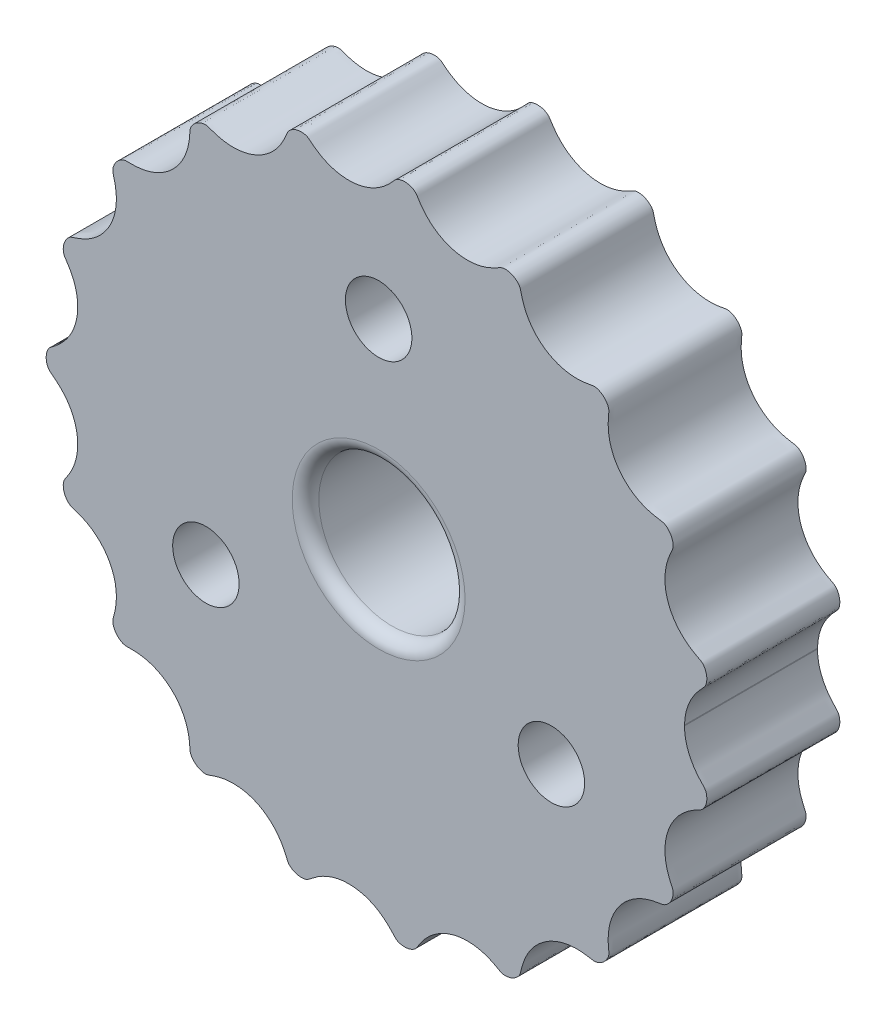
ISO-10303-21;
HEADER;
FILE_DESCRIPTION(('STEP AP214'),'2;1');
FILE_NAME('part.step','',(''),(''),'','','');
FILE_SCHEMA(('AUTOMOTIVE_DESIGN { 1 0 10303 214 1 1 1 1 }'));
ENDSEC;
DATA;
#1=APPLICATION_CONTEXT('core data for automotive mechanical design processes');
#2=APPLICATION_PROTOCOL_DEFINITION('international standard','automotive_design',2000,#1);
#3=PRODUCT_CONTEXT('',#1,'mechanical');
#4=PRODUCT('Part','Part','',(#3));
#5=PRODUCT_RELATED_PRODUCT_CATEGORY('part','',(#4));
#6=PRODUCT_DEFINITION_FORMATION('','',#4);
#7=PRODUCT_DEFINITION_CONTEXT('part definition',#1,'design');
#8=PRODUCT_DEFINITION('design','',#6,#7);
#9=PRODUCT_DEFINITION_SHAPE('','',#8);
#10=(LENGTH_UNIT() NAMED_UNIT(*) SI_UNIT(.MILLI.,.METRE.));
#11=(NAMED_UNIT(*) PLANE_ANGLE_UNIT() SI_UNIT($,.RADIAN.));
#12=(NAMED_UNIT(*) SI_UNIT($,.STERADIAN.) SOLID_ANGLE_UNIT());
#13=UNCERTAINTY_MEASURE_WITH_UNIT(LENGTH_MEASURE(1.E-05),#10,'distance_accuracy_value','');
#14=(GEOMETRIC_REPRESENTATION_CONTEXT(3) GLOBAL_UNCERTAINTY_ASSIGNED_CONTEXT((#13)) GLOBAL_UNIT_ASSIGNED_CONTEXT((#10,
#11,#12)) REPRESENTATION_CONTEXT('',''));
#15=CARTESIAN_POINT('',(0.,0.,0.));
#16=DIRECTION('',(0.,0.,1.));
#17=DIRECTION('',(1.,0.,0.));
#18=AXIS2_PLACEMENT_3D('',#15,#16,#17);
#19=CARTESIAN_POINT('',(0.,0.,0.));
#20=DIRECTION('',(0.,0.,1.));
#21=DIRECTION('',(1.,0.,0.));
#22=AXIS2_PLACEMENT_3D('',#19,#20,#21);
#23=PLANE('',#22);
#24=CARTESIAN_POINT('',(0.,15.,0.));
#25=DIRECTION('',(0.,0.,-1.));
#26=DIRECTION('',(-1.,0.,0.));
#27=AXIS2_PLACEMENT_3D('',#24,#25,#26);
#28=CIRCLE('',#27,2.5);
#29=CARTESIAN_POINT('',(-2.5,15.,0.));
#30=VERTEX_POINT('',#29);
#31=EDGE_CURVE('E172',#30,#30,#28,.T.);
#32=ORIENTED_EDGE('',*,*,#31,.F.);
#33=EDGE_LOOP('',(#32));
#34=FACE_BOUND('',#33,.T.);
#35=CARTESIAN_POINT('',(-12.9903810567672,-7.49999999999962,0.));
#36=DIRECTION('',(0.,0.,-1.));
#37=DIRECTION('',(-1.,0.,0.));
#38=AXIS2_PLACEMENT_3D('',#35,#36,#37);
#39=CIRCLE('',#38,2.50000000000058);
#40=CARTESIAN_POINT('',(-15.4903810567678,-7.49999999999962,0.));
#41=VERTEX_POINT('',#40);
#42=EDGE_CURVE('E174',#41,#41,#39,.T.);
#43=ORIENTED_EDGE('',*,*,#42,.F.);
#44=EDGE_LOOP('',(#43));
#45=FACE_BOUND('',#44,.T.);
#46=CARTESIAN_POINT('',(12.9903810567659,-7.50000000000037,0.));
#47=DIRECTION('',(0.,0.,-1.));
#48=DIRECTION('',(-1.,0.,0.));
#49=AXIS2_PLACEMENT_3D('',#46,#47,#48);
#50=CIRCLE('',#49,2.50000000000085);
#51=CARTESIAN_POINT('',(10.4903810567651,-7.50000000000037,0.));
#52=VERTEX_POINT('',#51);
#53=EDGE_CURVE('E185',#52,#52,#50,.T.);
#54=ORIENTED_EDGE('',*,*,#53,.F.);
#55=EDGE_LOOP('',(#54));
#56=FACE_BOUND('',#55,.T.);
#57=CARTESIAN_POINT('',(0.,0.,0.));
#58=DIRECTION('',(0.,0.,1.));
#59=DIRECTION('',(1.,0.,0.));
#60=AXIS2_PLACEMENT_3D('',#57,#58,#59);
#61=CIRCLE('',#60,6.5);
#62=CARTESIAN_POINT('',(6.5,0.,0.));
#63=VERTEX_POINT('',#62);
#64=EDGE_CURVE('E53',#63,#63,#61,.T.);
#65=ORIENTED_EDGE('',*,*,#64,.T.);
#66=EDGE_LOOP('',(#65));
#67=FACE_BOUND('',#66,.T.);
#68=CARTESIAN_POINT('',(23.0004450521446,0.0609374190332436,0.));
#69=CARTESIAN_POINT('',(23.0010644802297,0.103341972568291,0.));
#70=CARTESIAN_POINT('',(23.0038092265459,0.188906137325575,0.));
#71=CARTESIAN_POINT('',(23.0131501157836,0.367843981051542,0.));
#72=CARTESIAN_POINT('',(23.0334981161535,0.534909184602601,0.));
#73=CARTESIAN_POINT('',(23.0705654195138,0.786083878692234,0.));
#74=CARTESIAN_POINT('',(23.1320141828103,1.06083292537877,0.));
#75=CARTESIAN_POINT('',(23.2545603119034,1.4742128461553,0.));
#76=CARTESIAN_POINT('',(23.4419605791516,1.90190498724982,0.));
#77=CARTESIAN_POINT('',(23.6526500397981,2.26726702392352,0.));
#78=CARTESIAN_POINT('',(23.8668861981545,2.5657364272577,0.));
#79=CARTESIAN_POINT('',(24.0252943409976,2.76594758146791,0.));
#80=CARTESIAN_POINT('',(24.1558379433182,2.91651817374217,0.));
#81=CARTESIAN_POINT('',(24.2851186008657,3.05651856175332,0.));
#82=CARTESIAN_POINT('',(24.4048398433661,3.18265204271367,0.));
#83=CARTESIAN_POINT('',(24.4955538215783,3.27862792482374,0.));
#84=CARTESIAN_POINT('',(24.5776413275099,3.3978753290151,0.));
#85=CARTESIAN_POINT('',(24.6403019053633,3.55800179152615,0.));
#86=CARTESIAN_POINT('',(24.6804298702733,3.75861614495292,0.));
#87=CARTESIAN_POINT('',(24.6829995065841,3.99723654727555,0.));
#88=CARTESIAN_POINT('',(24.6407164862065,4.24466441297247,0.));
#89=CARTESIAN_POINT('',(24.5598566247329,4.46599330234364,0.));
#90=CARTESIAN_POINT('',(24.4632988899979,4.62969794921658,0.));
#91=CARTESIAN_POINT('',(24.3700046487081,4.74154404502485,0.));
#92=CARTESIAN_POINT('',(24.2934573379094,4.80789336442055,0.));
#93=CARTESIAN_POINT('',(24.2331727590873,4.84919927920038,0.));
#94=CARTESIAN_POINT('',(24.1436718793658,4.90049686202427,0.));
#95=CARTESIAN_POINT('',(24.0251482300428,4.96086436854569,0.));
#96=CARTESIAN_POINT('',(23.8813705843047,5.03731738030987,0.));
#97=CARTESIAN_POINT('',(23.712869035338,5.13135954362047,0.));
#98=CARTESIAN_POINT('',(23.5008423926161,5.25969202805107,0.));
#99=CARTESIAN_POINT('',(23.2503084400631,5.42998618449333,0.));
#100=CARTESIAN_POINT('',(22.9679235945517,5.6540978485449,0.));
#101=CARTESIAN_POINT('',(22.6665695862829,5.94375033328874,0.));
#102=CARTESIAN_POINT('',(22.3909280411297,6.26615978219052,0.));
#103=CARTESIAN_POINT('',(22.1456648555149,6.6198575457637,0.));
#104=CARTESIAN_POINT('',(21.8865384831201,7.09053710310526,0.));
#105=CARTESIAN_POINT('',(21.6972444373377,7.58461786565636,0.));
#106=CARTESIAN_POINT('',(21.5786507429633,8.08655156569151,0.));
#107=CARTESIAN_POINT('',(21.5272191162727,8.58267339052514,0.));
#108=CARTESIAN_POINT('',(21.5223920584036,8.96260511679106,0.));
#109=CARTESIAN_POINT('',(21.5508966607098,9.33550554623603,0.));
#110=CARTESIAN_POINT('',(21.6103337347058,9.69862880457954,0.));
#111=CARTESIAN_POINT('',(21.6878411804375,10.0086036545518,0.));
#112=CARTESIAN_POINT('',(21.7706113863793,10.2666438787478,0.));
#113=CARTESIAN_POINT('',(21.8498829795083,10.4781783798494,0.));
#114=CARTESIAN_POINT('',(21.919038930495,10.6454192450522,0.));
#115=CARTESIAN_POINT('',(21.9816260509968,10.7867118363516,0.));
#116=CARTESIAN_POINT('',(22.035042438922,10.9030063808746,0.));
#117=CARTESIAN_POINT('',(22.084453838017,11.0131731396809,0.));
#118=CARTESIAN_POINT('',(22.1290439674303,11.1266774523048,0.));
#119=CARTESIAN_POINT('',(22.1489992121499,11.2598240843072,0.));
#120=CARTESIAN_POINT('',(22.1435566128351,11.4053666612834,0.));
#121=CARTESIAN_POINT('',(22.1170450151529,11.5725890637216,0.));
#122=CARTESIAN_POINT('',(22.0633944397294,11.7504492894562,0.));
#123=CARTESIAN_POINT('',(21.9702363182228,11.946885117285,0.));
#124=CARTESIAN_POINT('',(21.8436701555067,12.1238066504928,0.));
#125=CARTESIAN_POINT('',(21.7133767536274,12.2560985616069,0.));
#126=CARTESIAN_POINT('',(21.5962964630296,12.3450186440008,0.));
#127=CARTESIAN_POINT('',(21.5025310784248,12.4008340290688,0.));
#128=CARTESIAN_POINT('',(21.3990220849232,12.4432188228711,0.));
#129=CARTESIAN_POINT('',(21.2868217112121,12.4679022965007,0.));
#130=CARTESIAN_POINT('',(21.130878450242,12.4903115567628,0.));
#131=CARTESIAN_POINT('',(20.953603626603,12.5182372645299,0.));
#132=CARTESIAN_POINT('',(20.7643712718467,12.5521053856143,0.));
#133=CARTESIAN_POINT('',(20.5194912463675,12.605928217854,0.));
#134=CARTESIAN_POINT('',(20.1600221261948,12.7034344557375,0.));
#135=CARTESIAN_POINT('',(19.6713346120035,12.8869653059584,0.));
#136=CARTESIAN_POINT('',(19.0810609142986,13.213737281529,0.));
#137=CARTESIAN_POINT('',(18.4823551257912,13.7066338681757,0.));
#138=CARTESIAN_POINT('',(17.9827894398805,14.3046626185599,0.));
#139=CARTESIAN_POINT('',(17.6070636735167,14.9758213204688,0.));
#140=CARTESIAN_POINT('',(17.3914134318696,15.6061212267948,0.));
#141=CARTESIAN_POINT('',(17.2886005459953,16.1631502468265,0.));
#142=CARTESIAN_POINT('',(17.2593961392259,16.5774164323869,0.));
#143=CARTESIAN_POINT('',(17.2581121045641,16.8499339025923,0.));
#144=CARTESIAN_POINT('',(17.2672347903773,17.070006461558,0.));
#145=CARTESIAN_POINT('',(17.2791263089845,17.2377183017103,0.));
#146=CARTESIAN_POINT('',(17.2934381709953,17.3967835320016,0.));
#147=CARTESIAN_POINT('',(17.3092886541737,17.5470541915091,0.));
#148=CARTESIAN_POINT('',(17.3188500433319,17.7044671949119,0.));
#149=CARTESIAN_POINT('',(17.2904355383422,17.8485405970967,0.));
#150=CARTESIAN_POINT('',(17.2386992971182,17.9815332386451,0.));
#151=CARTESIAN_POINT('',(17.1576230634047,18.1323633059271,0.));
#152=CARTESIAN_POINT('',(17.0476886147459,18.2836398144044,0.));
#153=CARTESIAN_POINT('',(16.8932226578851,18.4399573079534,0.));
#154=CARTESIAN_POINT('',(16.712767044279,18.5662875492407,0.));
#155=CARTESIAN_POINT('',(16.5434032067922,18.6483748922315,0.));
#156=CARTESIAN_POINT('',(16.3919147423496,18.695708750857,0.));
#157=CARTESIAN_POINT('',(16.2633999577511,18.7185500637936,0.));
#158=CARTESIAN_POINT('',(16.1187982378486,18.7114090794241,0.));
#159=CARTESIAN_POINT('',(15.9628511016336,18.6804311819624,0.));
#160=CARTESIAN_POINT('',(15.7955730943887,18.6509993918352,0.));
#161=CARTESIAN_POINT('',(15.6162821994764,18.6220231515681,0.));
#162=CARTESIAN_POINT('',(15.431926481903,18.5982744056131,0.));
#163=CARTESIAN_POINT('',(15.2424369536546,18.5806300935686,0.));
#164=CARTESIAN_POINT('',(14.9983346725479,18.5678165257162,0.));
#165=CARTESIAN_POINT('',(14.6978223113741,18.5692961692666,0.));
#166=CARTESIAN_POINT('',(14.3465623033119,18.5976695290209,0.));
#167=CARTESIAN_POINT('',(13.8413545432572,18.6865447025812,0.));
#168=CARTESIAN_POINT('',(13.3474045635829,18.8414163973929,0.));
#169=CARTESIAN_POINT('',(12.8766615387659,19.0607681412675,0.));
#170=CARTESIAN_POINT('',(12.4404070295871,19.3396979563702,0.));
#171=CARTESIAN_POINT('',(12.1194362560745,19.5923890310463,0.));
#172=CARTESIAN_POINT('',(11.82732244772,19.8724017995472,0.));
#173=CARTESIAN_POINT('',(11.5657738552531,20.1760918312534,0.));
#174=CARTESIAN_POINT('',(11.2824305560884,20.5759636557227,0.));
#175=CARTESIAN_POINT('',(11.074042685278,20.961211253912,0.));
#176=CARTESIAN_POINT('',(10.9260104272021,21.3181212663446,0.));
#177=CARTESIAN_POINT('',(10.8223643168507,21.6364879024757,0.));
#178=CARTESIAN_POINT('',(10.7696450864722,21.8218639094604,0.));
#179=CARTESIAN_POINT('',(10.7283691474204,21.9832781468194,0.));
#180=CARTESIAN_POINT('',(10.6965388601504,22.1195677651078,0.));
#181=CARTESIAN_POINT('',(10.6698067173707,22.2304212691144,0.));
#182=CARTESIAN_POINT('',(10.6459464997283,22.3149341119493,0.));
#183=CARTESIAN_POINT('',(10.6031755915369,22.4212366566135,0.));
#184=CARTESIAN_POINT('',(10.5340769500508,22.5263972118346,0.));
#185=CARTESIAN_POINT('',(10.4440730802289,22.6278247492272,0.));
#186=CARTESIAN_POINT('',(10.3090535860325,22.7454665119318,0.));
#187=CARTESIAN_POINT('',(10.1449197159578,22.8528142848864,0.));
#188=CARTESIAN_POINT('',(9.96573029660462,22.9333716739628,0.));
#189=CARTESIAN_POINT('',(9.77675296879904,22.9846340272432,0.));
#190=CARTESIAN_POINT('',(9.59966398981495,23.008128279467,0.));
#191=CARTESIAN_POINT('',(9.4518387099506,23.0082709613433,0.));
#192=CARTESIAN_POINT('',(9.30082605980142,22.9868990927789,0.));
#193=CARTESIAN_POINT('',(9.14843663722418,22.9195820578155,0.));
#194=CARTESIAN_POINT('',(9.00629573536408,22.8364891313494,0.));
#195=CARTESIAN_POINT('',(8.85136035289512,22.7515834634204,0.));
#196=CARTESIAN_POINT('',(8.68415685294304,22.6633743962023,0.));
#197=CARTESIAN_POINT('',(8.4659469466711,22.557985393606,0.));
#198=CARTESIAN_POINT('',(8.19346563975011,22.442983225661,0.));
#199=CARTESIAN_POINT('',(7.8577537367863,22.3290184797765,0.));
#200=CARTESIAN_POINT('',(7.45596770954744,22.2330420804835,0.));
#201=CARTESIAN_POINT('',(7.03996906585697,22.1755239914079,0.));
#202=CARTESIAN_POINT('',(6.61357111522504,22.1597399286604,0.));
#203=CARTESIAN_POINT('',(6.1032438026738,22.1928478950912,0.));
#204=CARTESIAN_POINT('',(5.60993913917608,22.2896928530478,0.));
#205=CARTESIAN_POINT('',(5.14338857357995,22.4442843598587,0.));
#206=CARTESIAN_POINT('',(4.71453132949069,22.6471757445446,0.));
#207=CARTESIAN_POINT('',(4.39111897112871,22.8375133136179,0.));
#208=CARTESIAN_POINT('',(4.08670751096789,23.0547537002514,0.));
#209=CARTESIAN_POINT('',(3.80304315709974,23.2967196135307,0.));
#210=CARTESIAN_POINT('',(3.54117376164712,23.5622918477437,0.));
#211=CARTESIAN_POINT('',(3.33135134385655,23.8136303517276,0.));
#212=CARTESIAN_POINT('',(3.16729935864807,24.0378234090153,0.));
#213=CARTESIAN_POINT('',(3.05128465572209,24.2110609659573,0.));
#214=CARTESIAN_POINT('',(2.97407854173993,24.3312155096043,0.));
#215=CARTESIAN_POINT('',(2.90893122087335,24.4353210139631,0.));
#216=CARTESIAN_POINT('',(2.8530196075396,24.5220232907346,0.));
#217=CARTESIAN_POINT('',(2.77763239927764,24.6216491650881,0.));
#218=CARTESIAN_POINT('',(2.67867992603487,24.7064419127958,0.));
#219=CARTESIAN_POINT('',(2.56349711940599,24.7759495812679,0.));
#220=CARTESIAN_POINT('',(2.4075865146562,24.8456503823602,0.));
#221=CARTESIAN_POINT('',(2.22835391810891,24.8981764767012,0.));
#222=CARTESIAN_POINT('',(2.01091815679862,24.9274566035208,0.));
#223=CARTESIAN_POINT('',(1.79118975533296,24.9173237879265,0.));
#224=CARTESIAN_POINT('',(1.6073060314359,24.8790281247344,0.));
#225=CARTESIAN_POINT('',(1.4665345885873,24.8274053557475,0.));
#226=CARTESIAN_POINT('',(1.36596425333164,24.7764513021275,0.));
#227=CARTESIAN_POINT('',(1.28490950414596,24.7171219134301,0.));
#228=CARTESIAN_POINT('',(1.22151119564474,24.6555969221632,0.));
#229=CARTESIAN_POINT('',(1.15343854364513,24.5815042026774,0.));
#230=CARTESIAN_POINT('',(1.07877477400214,24.4970564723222,0.));
#231=CARTESIAN_POINT('',(0.990419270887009,24.3996139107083,0.));
#232=CARTESIAN_POINT('',(0.879528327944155,24.2812996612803,0.));
#233=CARTESIAN_POINT('',(0.757233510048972,24.1576265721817,0.));
#234=CARTESIAN_POINT('',(0.586090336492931,23.9963966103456,0.));
#235=CARTESIAN_POINT('',(0.279913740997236,23.7377910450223,0.));
#236=CARTESIAN_POINT('',(-0.185417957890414,23.4210136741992,0.));
#237=CARTESIAN_POINT('',(-0.841139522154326,23.1135331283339,0.));
#238=CARTESIAN_POINT('',(-1.63279965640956,22.9187714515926,0.));
#239=CARTESIAN_POINT('',(-2.42970180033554,22.8811842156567,0.));
#240=CARTESIAN_POINT('',(-3.18969687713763,22.98750840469,0.));
#241=CARTESIAN_POINT('',(-3.80648197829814,23.1882776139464,0.));
#242=CARTESIAN_POINT('',(-4.25792544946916,23.40952083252,0.));
#243=CARTESIAN_POINT('',(-4.56567071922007,23.5972605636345,0.));
#244=CARTESIAN_POINT('',(-4.7458498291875,23.7196194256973,0.));
#245=CARTESIAN_POINT('',(-4.87956659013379,23.8169925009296,0.));
#246=CARTESIAN_POINT('',(-5.00520766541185,23.9132889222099,0.));
#247=CARTESIAN_POINT('',(-5.10839703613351,23.9954562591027,0.));
#248=CARTESIAN_POINT('',(-5.1962832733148,24.0667457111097,0.));
#249=CARTESIAN_POINT('',(-5.27555451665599,24.1275195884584,0.));
#250=CARTESIAN_POINT('',(-5.34752737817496,24.1751925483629,0.));
#251=CARTESIAN_POINT('',(-5.45544706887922,24.226628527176,0.));
#252=CARTESIAN_POINT('',(-5.61332665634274,24.2679019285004,0.));
#253=CARTESIAN_POINT('',(-5.81248805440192,24.2858139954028,0.));
#254=CARTESIAN_POINT('',(-6.04892210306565,24.2634708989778,0.));
#255=CARTESIAN_POINT('',(-6.28478849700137,24.1982333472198,0.));
#256=CARTESIAN_POINT('',(-6.4910822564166,24.0996183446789,0.));
#257=CARTESIAN_POINT('',(-6.6528295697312,23.9826572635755,0.));
#258=CARTESIAN_POINT('',(-6.7731717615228,23.8583116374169,0.));
#259=CARTESIAN_POINT('',(-6.83961553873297,23.7424509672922,0.));
#260=CARTESIAN_POINT('',(-6.88287024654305,23.6417345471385,0.));
#261=CARTESIAN_POINT('',(-6.92897548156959,23.5322327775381,0.));
#262=CARTESIAN_POINT('',(-6.97918741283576,23.4142809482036,0.));
#263=CARTESIAN_POINT('',(-7.04005614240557,23.2775073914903,0.));
#264=CARTESIAN_POINT('',(-7.11617893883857,23.1178274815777,0.));
#265=CARTESIAN_POINT('',(-7.20056760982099,22.9555859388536,0.));
#266=CARTESIAN_POINT('',(-7.3180100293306,22.7492499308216,0.));
#267=CARTESIAN_POINT('',(-7.47816968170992,22.5012513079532,0.));
#268=CARTESIAN_POINT('',(-7.68753153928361,22.2243018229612,0.));
#269=CARTESIAN_POINT('',(-7.95814510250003,21.9275718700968,0.));
#270=CARTESIAN_POINT('',(-8.2599123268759,21.6541948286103,0.));
#271=CARTESIAN_POINT('',(-8.66083173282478,21.3562771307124,0.));
#272=CARTESIAN_POINT('',(-9.18181951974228,21.0633248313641,0.));
#273=CARTESIAN_POINT('',(-9.7353655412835,20.8583848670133,0.));
#274=CARTESIAN_POINT('',(-10.3037773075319,20.7431634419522,0.));
#275=CARTESIAN_POINT('',(-10.7833094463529,20.705631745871,0.));
#276=CARTESIAN_POINT('',(-11.1616253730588,20.7096634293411,0.));
#277=CARTESIAN_POINT('',(-11.5388634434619,20.7468047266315,0.));
#278=CARTESIAN_POINT('',(-11.8655396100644,20.8075028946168,0.));
#279=CARTESIAN_POINT('',(-12.1413237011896,20.878074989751,0.));
#280=CARTESIAN_POINT('',(-12.3518739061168,20.943093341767,0.));
#281=CARTESIAN_POINT('',(-12.5000613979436,20.9929725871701,0.));
#282=CARTESIAN_POINT('',(-12.6314970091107,21.0397639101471,0.));
#283=CARTESIAN_POINT('',(-12.7469137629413,21.0816629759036,0.));
#284=CARTESIAN_POINT('',(-12.8816892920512,21.1275848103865,0.));
#285=CARTESIAN_POINT('',(-13.0232174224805,21.1443617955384,0.));
#286=CARTESIAN_POINT('',(-13.1646854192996,21.131095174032,0.));
#287=CARTESIAN_POINT('',(-13.3350151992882,21.0938854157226,0.));
#288=CARTESIAN_POINT('',(-13.5127331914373,21.0275671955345,0.));
#289=CARTESIAN_POINT('',(-13.70771107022,20.918241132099,0.));
#290=CARTESIAN_POINT('',(-13.8803938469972,20.7741716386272,0.));
#291=CARTESIAN_POINT('',(-14.0059492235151,20.6294351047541,0.));
#292=CARTESIAN_POINT('',(-14.0873372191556,20.5014982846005,0.));
#293=CARTESIAN_POINT('',(-14.1362001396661,20.400514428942,0.));
#294=CARTESIAN_POINT('',(-14.1696652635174,20.2905284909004,0.));
#295=CARTESIAN_POINT('',(-14.1839673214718,20.173300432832,0.));
#296=CARTESIAN_POINT('',(-14.1936306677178,20.0116167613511,0.));
#297=CARTESIAN_POINT('',(-14.207496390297,19.8274109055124,0.));
#298=CARTESIAN_POINT('',(-14.2268591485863,19.6305753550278,0.));
#299=CARTESIAN_POINT('',(-14.26271195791,19.375130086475,0.));
#300=CARTESIAN_POINT('',(-14.3350990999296,18.9985849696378,0.));
#301=CARTESIAN_POINT('',(-14.4878193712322,18.4826931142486,0.));
#302=CARTESIAN_POINT('',(-14.7830279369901,17.8542035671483,0.));
#303=CARTESIAN_POINT('',(-15.2484658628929,17.213007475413,0.));
#304=CARTESIAN_POINT('',(-15.823885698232,16.6734473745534,0.));
#305=CARTESIAN_POINT('',(-16.3973526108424,16.3085128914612,0.));
#306=CARTESIAN_POINT('',(-16.9177749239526,16.0786260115,0.));
#307=CARTESIAN_POINT('',(-17.3647339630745,15.9410111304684,0.));
#308=CARTESIAN_POINT('',(-17.7248018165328,15.8628091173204,0.));
#309=CARTESIAN_POINT('',(-18.0412846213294,15.820863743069,0.));
#310=CARTESIAN_POINT('',(-18.3106294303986,15.802325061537,0.));
#311=CARTESIAN_POINT('',(-18.5320417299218,15.7969443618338,0.));
#312=CARTESIAN_POINT('',(-18.6836276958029,15.7969225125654,0.));
#313=CARTESIAN_POINT('',(-18.8132574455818,15.7990809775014,0.));
#314=CARTESIAN_POINT('',(-18.9269805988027,15.8005385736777,0.));
#315=CARTESIAN_POINT('',(-19.0245949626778,15.7984869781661,0.));
#316=CARTESIAN_POINT('',(-19.1503625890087,15.7793808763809,0.));
#317=CARTESIAN_POINT('',(-19.2786587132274,15.7292741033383,0.));
#318=CARTESIAN_POINT('',(-19.4017458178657,15.6607359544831,0.));
#319=CARTESIAN_POINT('',(-19.5437475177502,15.5557400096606,0.));
#320=CARTESIAN_POINT('',(-19.6794119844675,15.4254489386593,0.));
#321=CARTESIAN_POINT('',(-19.8125272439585,15.252166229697,0.));
#322=CARTESIAN_POINT('',(-19.9195409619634,15.0445062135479,0.));
#323=CARTESIAN_POINT('',(-19.9741862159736,14.8643202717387,0.));
#324=CARTESIAN_POINT('',(-19.993465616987,14.721716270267,0.));
#325=CARTESIAN_POINT('',(-19.9911465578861,14.6219173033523,0.));
#326=CARTESIAN_POINT('',(-19.9814906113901,14.5508659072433,0.));
#327=CARTESIAN_POINT('',(-19.9596359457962,14.4520422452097,0.));
#328=CARTESIAN_POINT('',(-19.9244302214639,14.3263366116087,0.));
#329=CARTESIAN_POINT('',(-19.8839286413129,14.1718166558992,0.));
#330=CARTESIAN_POINT('',(-19.83941825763,13.9878017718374,0.));
#331=CARTESIAN_POINT('',(-19.7902400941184,13.7494276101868,0.));
#332=CARTESIAN_POINT('',(-19.7451420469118,13.4551748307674,0.));
#333=CARTESIAN_POINT('',(-19.7169078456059,13.1023532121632,0.));
#334=CARTESIAN_POINT('',(-19.722218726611,12.6922723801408,0.));
#335=CARTESIAN_POINT('',(-19.7673351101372,12.2788625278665,0.));
#336=CARTESIAN_POINT('',(-19.85423085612,11.8662508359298,0.));
#337=CARTESIAN_POINT('',(-20.0143814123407,11.3636435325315,0.));
#338=CARTESIAN_POINT('',(-20.2770751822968,10.8105198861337,0.));
#339=CARTESIAN_POINT('',(-20.6164390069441,10.3191130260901,0.));
#340=CARTESIAN_POINT('',(-21.0150684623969,9.899172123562,0.));
#341=CARTESIAN_POINT('',(-21.3660194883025,9.60628322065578,0.));
#342=CARTESIAN_POINT('',(-21.6595973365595,9.40050749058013,0.));
#343=CARTESIAN_POINT('',(-21.9661729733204,9.22095812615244,0.));
#344=CARTESIAN_POINT('',(-22.2434766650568,9.08647526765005,0.));
#345=CARTESIAN_POINT('',(-22.487141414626,8.985853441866,0.));
#346=CARTESIAN_POINT('',(-22.6971275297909,8.90966358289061,0.));
#347=CARTESIAN_POINT('',(-22.8484016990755,8.85832288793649,0.));
#348=CARTESIAN_POINT('',(-22.9816290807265,8.81586827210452,0.));
#349=CARTESIAN_POINT('',(-23.0968211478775,8.7757949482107,0.));
#350=CARTESIAN_POINT('',(-23.1870132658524,8.73389595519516,0.));
#351=CARTESIAN_POINT('',(-23.2911900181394,8.66248407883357,0.));
#352=CARTESIAN_POINT('',(-23.4082170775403,8.54904085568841,0.));
#353=CARTESIAN_POINT('',(-23.5263335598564,8.39080511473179,0.));
#354=CARTESIAN_POINT('',(-23.6303183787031,8.18310432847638,0.));
#355=CARTESIAN_POINT('',(-23.6995028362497,7.95346432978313,0.));
#356=CARTESIAN_POINT('',(-23.726069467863,7.73085575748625,0.));
#357=CARTESIAN_POINT('',(-23.7141681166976,7.53088332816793,0.));
#358=CARTESIAN_POINT('',(-23.6712468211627,7.35676687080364,0.));
#359=CARTESIAN_POINT('',(-23.587535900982,7.2107568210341,0.));
#360=CARTESIAN_POINT('',(-23.4888308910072,7.07016675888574,0.));
#361=CARTESIAN_POINT('',(-23.3882676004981,6.91694785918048,0.));
#362=CARTESIAN_POINT('',(-23.2843627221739,6.75241089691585,0.));
#363=CARTESIAN_POINT('',(-23.1587096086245,6.53560145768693,0.));
#364=CARTESIAN_POINT('',(-23.0192784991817,6.26245241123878,0.));
#365=CARTESIAN_POINT('',(-22.877747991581,5.92438993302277,0.));
#366=CARTESIAN_POINT('',(-22.7518654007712,5.51735194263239,0.));
#367=CARTESIAN_POINT('',(-22.6663634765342,5.09510154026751,0.));
#368=CARTESIAN_POINT('',(-22.624177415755,4.66168506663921,0.));
#369=CARTESIAN_POINT('',(-22.6277437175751,4.14416476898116,0.));
#370=CARTESIAN_POINT('',(-22.6969215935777,3.64321925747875,0.));
#371=CARTESIAN_POINT('',(-22.8250601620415,3.16849461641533,0.));
#372=CARTESIAN_POINT('',(-23.0025794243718,2.73028397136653,0.));
#373=CARTESIAN_POINT('',(-23.1734074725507,2.39759943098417,0.));
#374=CARTESIAN_POINT('',(-23.3714935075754,2.08291514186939,0.));
#375=CARTESIAN_POINT('',(-23.5945603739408,1.7879594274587,0.));
#376=CARTESIAN_POINT('',(-23.8110817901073,1.54694379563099,0.));
#377=CARTESIAN_POINT('',(-24.0104853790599,1.35312204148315,0.));
#378=CARTESIAN_POINT('',(-24.1832927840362,1.20112568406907,0.));
#379=CARTESIAN_POINT('',(-24.3242369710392,1.08551778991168,0.));
#380=CARTESIAN_POINT('',(-24.4487192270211,0.988664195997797,0.));
#381=CARTESIAN_POINT('',(-24.5548708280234,0.908952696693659,0.));
#382=CARTESIAN_POINT('',(-24.6411994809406,0.843342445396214,0.));
#383=CARTESIAN_POINT('',(-24.7061246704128,0.790339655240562,0.));
#384=CARTESIAN_POINT('',(-24.7831824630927,0.713841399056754,0.));
#385=CARTESIAN_POINT('',(-24.8504413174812,0.615615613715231,0.));
#386=CARTESIAN_POINT('',(-24.9066420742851,0.500126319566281,0.));
#387=CARTESIAN_POINT('',(-24.9616031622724,0.339906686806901,0.));
#388=CARTESIAN_POINT('',(-24.9980291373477,0.156872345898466,0.));
#389=CARTESIAN_POINT('',(-25.0079752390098,-0.0615272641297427,0.));
#390=CARTESIAN_POINT('',(-24.9788835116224,-0.278375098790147,0.));
#391=CARTESIAN_POINT('',(-24.9250325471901,-0.457300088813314,0.));
#392=CARTESIAN_POINT('',(-24.8613331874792,-0.59323127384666,0.));
#393=CARTESIAN_POINT('',(-24.8008989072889,-0.690159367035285,0.));
#394=CARTESIAN_POINT('',(-24.7323333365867,-0.767244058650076,0.));
#395=CARTESIAN_POINT('',(-24.6619915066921,-0.827034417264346,0.));
#396=CARTESIAN_POINT('',(-24.5779706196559,-0.89154104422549,0.));
#397=CARTESIAN_POINT('',(-24.482308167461,-0.963016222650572,0.));
#398=CARTESIAN_POINT('',(-24.3719847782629,-1.04823760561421,0.));
#399=CARTESIAN_POINT('',(-24.2390268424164,-1.15462412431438,0.));
#400=CARTESIAN_POINT('',(-24.1011027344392,-1.27221831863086,0.));
#401=CARTESIAN_POINT('',(-23.9221175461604,-1.43660713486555,0.));
#402=CARTESIAN_POINT('',(-23.6362767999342,-1.73077995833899,0.));
#403=CARTESIAN_POINT('',(-23.281762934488,-2.1835918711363,0.));
#404=CARTESIAN_POINT('',(-22.9271870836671,-2.83084957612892,0.));
#405=CARTESIAN_POINT('',(-22.6825732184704,-3.62085086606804,0.));
#406=CARTESIAN_POINT('',(-22.599242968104,-4.42206812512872,0.));
#407=CARTESIAN_POINT('',(-22.6560153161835,-5.10075585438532,0.));
#408=CARTESIAN_POINT('',(-22.7839328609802,-5.64508269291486,0.));
#409=CARTESIAN_POINT('',(-22.9383125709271,-6.07567291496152,0.));
#410=CARTESIAN_POINT('',(-23.0687206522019,-6.36331346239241,0.));
#411=CARTESIAN_POINT('',(-23.1954045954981,-6.60097575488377,0.));
#412=CARTESIAN_POINT('',(-23.3169904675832,-6.80553099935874,0.));
#413=CARTESIAN_POINT('',(-23.4134801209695,-6.95589523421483,0.));
#414=CARTESIAN_POINT('',(-23.5046446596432,-7.09189883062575,0.));
#415=CARTESIAN_POINT('',(-23.5869866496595,-7.21312038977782,0.));
#416=CARTESIAN_POINT('',(-23.6458842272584,-7.31129955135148,0.));
#417=CARTESIAN_POINT('',(-23.6936359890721,-7.43717701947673,0.));
#418=CARTESIAN_POINT('',(-23.7216283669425,-7.60152763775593,0.));
#419=CARTESIAN_POINT('',(-23.7223084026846,-7.80201130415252,0.));
#420=CARTESIAN_POINT('',(-23.6806344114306,-8.03349246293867,0.));
#421=CARTESIAN_POINT('',(-23.59593129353,-8.26306779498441,0.));
#422=CARTESIAN_POINT('',(-23.4800063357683,-8.4610170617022,0.));
#423=CARTESIAN_POINT('',(-23.3487704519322,-8.61326074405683,0.));
#424=CARTESIAN_POINT('',(-23.2127158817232,-8.7238612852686,0.));
#425=CARTESIAN_POINT('',(-23.0663566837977,-8.78968521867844,0.));
#426=CARTESIAN_POINT('',(-22.9125310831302,-8.83693719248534,0.));
#427=CARTESIAN_POINT('',(-22.748877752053,-8.89193738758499,0.));
#428=CARTESIAN_POINT('',(-22.5744954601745,-8.95337392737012,0.));
#429=CARTESIAN_POINT('',(-22.3540791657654,-9.03952140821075,0.));
#430=CARTESIAN_POINT('',(-22.0907560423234,-9.15759161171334,0.));
#431=CARTESIAN_POINT('',(-21.7859013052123,-9.3207230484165,0.));
#432=CARTESIAN_POINT('',(-21.4493417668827,-9.54194913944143,0.));
#433=CARTESIAN_POINT('',(-21.1295614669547,-9.79839843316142,0.));
#434=CARTESIAN_POINT('',(-20.8313398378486,-10.0897970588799,0.));
#435=CARTESIAN_POINT('',(-20.5060815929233,-10.4778880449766,0.));
#436=CARTESIAN_POINT('',(-20.2354524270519,-10.9007400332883,0.));
#437=CARTESIAN_POINT('',(-20.0234952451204,-11.3478403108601,0.));
#438=CARTESIAN_POINT('',(-19.8724944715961,-11.8050881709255,0.));
#439=CARTESIAN_POINT('',(-19.786480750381,-12.1771034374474,0.));
#440=CARTESIAN_POINT('',(-19.7342884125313,-12.5535769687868,0.));
#441=CARTESIAN_POINT('',(-19.7154994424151,-12.9315657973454,0.));
#442=CARTESIAN_POINT('',(-19.7297872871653,-13.3095414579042,0.));
#443=CARTESIAN_POINT('',(-19.7703384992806,-13.6387799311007,0.));
#444=CARTESIAN_POINT('',(-19.822738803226,-13.9153600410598,0.));
#445=CARTESIAN_POINT('',(-19.8775380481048,-14.1470425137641,0.));
#446=CARTESIAN_POINT('',(-19.9208953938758,-14.3131728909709,0.));
#447=CARTESIAN_POINT('',(-19.9621623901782,-14.4593821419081,0.));
#448=CARTESIAN_POINT('',(-19.9940619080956,-14.6091198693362,0.));
#449=CARTESIAN_POINT('',(-19.9941902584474,-14.7408999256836,0.));
#450=CARTESIAN_POINT('',(-19.9694030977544,-14.8748164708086,0.));
#451=CARTESIAN_POINT('',(-19.9174563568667,-15.0391698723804,0.));
#452=CARTESIAN_POINT('',(-19.8355386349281,-15.2103657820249,0.));
#453=CARTESIAN_POINT('',(-19.7097922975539,-15.394155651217,0.));
#454=CARTESIAN_POINT('',(-19.5524111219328,-15.5524234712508,0.));
#455=CARTESIAN_POINT('',(-19.3980896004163,-15.66434186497,0.));
#456=CARTESIAN_POINT('',(-19.2638687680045,-15.7341888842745,0.));
#457=CARTESIAN_POINT('',(-19.1585412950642,-15.7741625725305,0.));
#458=CARTESIAN_POINT('',(-19.0429650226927,-15.7980324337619,0.));
#459=CARTESIAN_POINT('',(-18.9192143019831,-15.8013130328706,0.));
#460=CARTESIAN_POINT('',(-18.7472333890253,-15.7970987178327,0.));
#461=CARTESIAN_POINT('',(-18.5515487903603,-15.7964119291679,0.));
#462=CARTESIAN_POINT('',(-18.3443653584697,-15.8008032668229,0.));
#463=CARTESIAN_POINT('',(-18.0778543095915,-15.8186981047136,0.));
#464=CARTESIAN_POINT('',(-17.6884272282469,-15.865276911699,0.));
#465=CARTESIAN_POINT('',(-17.1511717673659,-15.9855809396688,0.));
#466=CARTESIAN_POINT('',(-16.491481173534,-16.2456853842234,0.));
#467=CARTESIAN_POINT('',(-15.8123440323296,-16.6796683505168,0.));
#468=CARTESIAN_POINT('',(-15.2347483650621,-17.2299118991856,0.));
#469=CARTESIAN_POINT('',(-14.7820895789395,-17.8614300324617,0.));
#470=CARTESIAN_POINT('',(-14.4987938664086,-18.4602384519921,0.));
#471=CARTESIAN_POINT('',(-14.3484234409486,-18.9506966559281,0.));
#472=CARTESIAN_POINT('',(-14.2744379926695,-19.3095687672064,0.));
#473=CARTESIAN_POINT('',(-14.2356753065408,-19.5599770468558,0.));
#474=CARTESIAN_POINT('',(-14.2135300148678,-19.7574429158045,0.));
#475=CARTESIAN_POINT('',(-14.1984406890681,-19.9464050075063,0.));
#476=CARTESIAN_POINT('',(-14.1869135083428,-20.1194013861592,0.));
#477=CARTESIAN_POINT('',(-14.1772264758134,-20.2506342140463,0.));
#478=CARTESIAN_POINT('',(-14.1432637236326,-20.3907384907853,0.));
#479=CARTESIAN_POINT('',(-14.0670190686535,-20.5439346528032,0.));
#480=CARTESIAN_POINT('',(-13.9463238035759,-20.7079390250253,0.));
#481=CARTESIAN_POINT('',(-13.7726838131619,-20.8699590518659,0.));
#482=CARTESIAN_POINT('',(-13.5626064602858,-21.0051884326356,0.));
#483=CARTESIAN_POINT('',(-13.3458445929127,-21.0946672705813,0.));
#484=CARTESIAN_POINT('',(-13.1606618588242,-21.1340559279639,0.));
#485=CARTESIAN_POINT('',(-13.0154934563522,-21.1409328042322,0.));
#486=CARTESIAN_POINT('',(-12.9147776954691,-21.1293423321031,0.));
#487=CARTESIAN_POINT('',(-12.8431971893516,-21.1126992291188,0.));
#488=CARTESIAN_POINT('',(-12.7443393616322,-21.0812522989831,0.));
#489=CARTESIAN_POINT('',(-12.618960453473,-21.0346928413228,0.));
#490=CARTESIAN_POINT('',(-12.4644514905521,-20.9804324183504,0.));
#491=CARTESIAN_POINT('',(-12.2800722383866,-20.9199483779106,0.));
#492=CARTESIAN_POINT('',(-12.0407156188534,-20.8507689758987,0.));
#493=CARTESIAN_POINT('',(-11.7441360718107,-20.7818718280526,0.));
#494=CARTESIAN_POINT('',(-11.3859714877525,-20.7263071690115,0.));
#495=CARTESIAN_POINT('',(-10.9663821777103,-20.7016950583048,0.));
#496=CARTESIAN_POINT('',(-10.5400901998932,-20.718700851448,0.));
#497=CARTESIAN_POINT('',(-10.0057507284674,-20.7948541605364,0.));
#498=CARTESIAN_POINT('',(-9.48522843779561,-20.9439687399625,0.));
#499=CARTESIAN_POINT('',(-8.9999733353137,-21.1593640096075,0.));
#500=CARTESIAN_POINT('',(-8.56103981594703,-21.4293105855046,0.));
#501=CARTESIAN_POINT('',(-8.24840665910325,-21.665143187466,0.));
#502=CARTESIAN_POINT('',(-7.96834487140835,-21.9190171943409,0.));
#503=CARTESIAN_POINT('',(-7.71592832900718,-22.1921854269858,0.));
#504=CARTESIAN_POINT('',(-7.49148796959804,-22.4810340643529,0.));
#505=CARTESIAN_POINT('',(-7.31777393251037,-22.7471219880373,0.));
#506=CARTESIAN_POINT('',(-7.18529345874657,-22.9819952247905,0.));
#507=CARTESIAN_POINT('',(-7.0842516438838,-23.1830190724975,0.));
#508=CARTESIAN_POINT('',(-7.00856178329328,-23.3468667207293,0.));
#509=CARTESIAN_POINT('',(-6.94736540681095,-23.4881641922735,0.));
#510=CARTESIAN_POINT('',(-6.89842040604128,-23.6057776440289,0.));
#511=CARTESIAN_POINT('',(-6.85077043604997,-23.7158356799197,0.));
#512=CARTESIAN_POINT('',(-6.79658298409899,-23.8241479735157,0.));
#513=CARTESIAN_POINT('',(-6.71118125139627,-23.9271512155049,0.));
#514=CARTESIAN_POINT('',(-6.6006094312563,-24.0204484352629,0.));
#515=CARTESIAN_POINT('',(-6.45971156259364,-24.1129130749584,0.));
#516=CARTESIAN_POINT('',(-6.29313141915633,-24.1927464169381,0.));
#517=CARTESIAN_POINT('',(-6.08637470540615,-24.2561989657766,0.));
#518=CARTESIAN_POINT('',(-5.87153847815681,-24.2822335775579,0.));
#519=CARTESIAN_POINT('',(-5.68693790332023,-24.2756373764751,0.));
#520=CARTESIAN_POINT('',(-5.5427537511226,-24.2496031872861,0.));
#521=CARTESIAN_POINT('',(-5.43826830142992,-24.2182745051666,0.));
#522=CARTESIAN_POINT('',(-5.33678403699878,-24.1704369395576,0.));
#523=CARTESIAN_POINT('',(-5.24222400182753,-24.1039090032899,0.));
#524=CARTESIAN_POINT('',(-5.1193477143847,-24.0036919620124,0.));
#525=CARTESIAN_POINT('',(-4.97774686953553,-23.8914820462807,0.));
#526=CARTESIAN_POINT('',(-4.8235593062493,-23.7745521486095,0.));
#527=CARTESIAN_POINT('',(-4.61656485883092,-23.6301676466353,0.));
#528=CARTESIAN_POINT('',(-4.29889720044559,-23.4309620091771,0.));
#529=CARTESIAN_POINT('',(-3.82902320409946,-23.1952819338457,0.));
#530=CARTESIAN_POINT('',(-3.18377275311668,-22.9832848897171,0.));
#531=CARTESIAN_POINT('',(-2.41193691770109,-22.8800329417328,0.));
#532=CARTESIAN_POINT('',(-1.63302094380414,-22.921923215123,0.));
#533=CARTESIAN_POINT('',(-0.887269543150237,-23.1037030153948,0.));
#534=CARTESIAN_POINT('',(-0.281567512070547,-23.3733905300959,0.));
#535=CARTESIAN_POINT('',(0.194350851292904,-23.6752129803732,0.));
#536=CARTESIAN_POINT('',(0.51661852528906,-23.9340260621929,0.));
#537=CARTESIAN_POINT('',(0.71665654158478,-24.1173384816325,0.));
#538=CARTESIAN_POINT('',(0.871449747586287,-24.272798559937,0.));
#539=CARTESIAN_POINT('',(0.986207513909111,-24.3949086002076,0.));
#540=CARTESIAN_POINT('',(1.0929201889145,-24.5126035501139,0.));
#541=CARTESIAN_POINT('',(1.19190515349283,-24.625420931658,0.));
#542=CARTESIAN_POINT('',(1.30175329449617,-24.7374351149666,0.));
#543=CARTESIAN_POINT('',(1.42719632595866,-24.8122529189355,0.));
#544=CARTESIAN_POINT('',(1.55973942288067,-24.8633726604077,0.));
#545=CARTESIAN_POINT('',(1.72543451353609,-24.9048794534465,0.));
#546=CARTESIAN_POINT('',(1.91039113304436,-24.9256576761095,0.));
#547=CARTESIAN_POINT('',(2.12896751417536,-24.9172121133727,0.));
#548=CARTESIAN_POINT('',(2.34307020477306,-24.8697627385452,0.));
#549=CARTESIAN_POINT('',(2.51716990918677,-24.8007028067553,0.));
#550=CARTESIAN_POINT('',(2.65427971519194,-24.7214006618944,0.));
#551=CARTESIAN_POINT('',(2.74416188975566,-24.6523005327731,0.));
#552=CARTESIAN_POINT('',(2.8107409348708,-24.5787971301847,0.));
#553=CARTESIAN_POINT('',(2.87712116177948,-24.4860368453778,0.));
#554=CARTESIAN_POINT('',(2.94337025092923,-24.3793613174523,0.));
#555=CARTESIAN_POINT('',(3.02603718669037,-24.2496052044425,0.));
#556=CARTESIAN_POINT('',(3.12701413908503,-24.0973984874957,0.));
#557=CARTESIAN_POINT('',(3.26398205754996,-23.904047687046,0.));
#558=CARTESIAN_POINT('',(3.4440513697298,-23.674800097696,0.));
#559=CARTESIAN_POINT('',(3.67772189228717,-23.4168202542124,0.));
#560=CARTESIAN_POINT('',(3.97550664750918,-23.1429338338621,0.));
#561=CARTESIAN_POINT('',(4.30226720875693,-22.8948310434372,0.));
#562=CARTESIAN_POINT('',(4.65651825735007,-22.6766608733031,0.));
#563=CARTESIAN_POINT('',(5.03202722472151,-22.4940848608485,0.));
#564=CARTESIAN_POINT('',(5.42531107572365,-22.3495600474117,0.));
#565=CARTESIAN_POINT('',(5.82601540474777,-22.2462818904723,0.));
#566=CARTESIAN_POINT('',(6.22978333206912,-22.1835933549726,0.));
#567=CARTESIAN_POINT('',(6.63282472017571,-22.1606595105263,0.));
#568=CARTESIAN_POINT('',(7.03133133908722,-22.1758984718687,0.));
#569=CARTESIAN_POINT('',(7.5145815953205,-22.2401734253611,0.));
#570=CARTESIAN_POINT('',(7.93642325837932,-22.3488061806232,0.));
#571=CARTESIAN_POINT('',(8.29689005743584,-22.4820755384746,0.));
#572=CARTESIAN_POINT('',(8.59939412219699,-22.6214240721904,0.));
#573=CARTESIAN_POINT('',(8.77040029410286,-22.7081631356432,0.));
#574=CARTESIAN_POINT('',(8.91633144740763,-22.7867434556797,0.));
#575=CARTESIAN_POINT('',(9.03741235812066,-22.855573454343,0.));
#576=CARTESIAN_POINT('',(9.13671249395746,-22.9105040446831,0.));
#577=CARTESIAN_POINT('',(9.21498400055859,-22.9493669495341,0.));
#578=CARTESIAN_POINT('',(9.32221861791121,-22.9883278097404,0.));
#579=CARTESIAN_POINT('',(9.44603735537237,-23.0073670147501,0.));
#580=CARTESIAN_POINT('',(9.58099088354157,-23.0090433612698,0.));
#581=CARTESIAN_POINT('',(9.75806508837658,-22.988506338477,0.));
#582=CARTESIAN_POINT('',(9.94704029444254,-22.9399571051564,0.));
#583=CARTESIAN_POINT('',(10.1264812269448,-22.8624917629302,0.));
#584=CARTESIAN_POINT('',(10.2911124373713,-22.7583270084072,0.));
#585=CARTESIAN_POINT('',(10.427360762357,-22.6442356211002,0.));
#586=CARTESIAN_POINT('',(10.5273388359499,-22.5356880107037,0.));
#587=CARTESIAN_POINT('',(10.6134828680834,-22.4097529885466,0.));
#588=CARTESIAN_POINT('',(10.6596414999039,-22.2740877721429,0.));
#589=CARTESIAN_POINT('',(10.6867141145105,-22.1589844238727,0.));
#590=CARTESIAN_POINT('',(10.7169917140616,-22.0322284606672,0.));
#591=CARTESIAN_POINT('',(10.7510613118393,-21.8937068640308,0.));
#592=CARTESIAN_POINT('',(10.7940703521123,-21.7328912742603,0.));
#593=CARTESIAN_POINT('',(10.864967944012,-21.499403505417,0.));
#594=CARTESIAN_POINT('',(10.9662014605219,-21.2192268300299,0.));
#595=CARTESIAN_POINT('',(11.1115290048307,-20.8929846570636,0.));
#596=CARTESIAN_POINT('',(11.3157466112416,-20.5303408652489,0.));
#597=CARTESIAN_POINT('',(11.5582577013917,-20.1838253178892,0.));
#598=CARTESIAN_POINT('',(11.8388764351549,-19.8585541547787,0.));
#599=CARTESIAN_POINT('',(12.2149007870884,-19.5036466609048,0.));
#600=CARTESIAN_POINT('',(12.6278235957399,-19.2051943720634,0.));
#601=CARTESIAN_POINT('',(13.0666135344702,-18.9667198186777,0.));
#602=CARTESIAN_POINT('',(13.6042585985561,-18.7559343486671,0.));
#603=CARTESIAN_POINT('',(14.0692576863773,-18.6360894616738,0.));
#604=CARTESIAN_POINT('',(14.5428827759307,-18.5729420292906,0.));
#605=CARTESIAN_POINT('',(14.9675720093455,-18.5655428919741,0.));
#606=CARTESIAN_POINT('',(15.2504924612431,-18.5802384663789,0.));
#607=CARTESIAN_POINT('',(15.4825468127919,-18.604172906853,0.));
#608=CARTESIAN_POINT('',(15.6640125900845,-18.6292353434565,0.));
#609=CARTESIAN_POINT('',(15.8370194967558,-18.6581487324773,0.));
#610=CARTESIAN_POINT('',(15.9826504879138,-18.6847435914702,0.));
#611=CARTESIAN_POINT('',(16.1023977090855,-18.706443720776,0.));
#612=CARTESIAN_POINT('',(16.2280108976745,-18.7182563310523,0.));
#613=CARTESIAN_POINT('',(16.3771478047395,-18.7041419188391,0.));
#614=CARTESIAN_POINT('',(16.5632562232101,-18.6445492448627,0.));
#615=CARTESIAN_POINT('',(16.7740949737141,-18.5305599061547,0.));
#616=CARTESIAN_POINT('',(16.9705535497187,-18.3697487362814,0.));
#617=CARTESIAN_POINT('',(17.1156848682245,-18.199184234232,0.));
#618=CARTESIAN_POINT('',(17.2143314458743,-18.0351978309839,0.));
#619=CARTESIAN_POINT('',(17.2727649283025,-17.8946372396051,0.));
#620=CARTESIAN_POINT('',(17.3037318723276,-17.7847962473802,0.));
#621=CARTESIAN_POINT('',(17.3148273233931,-17.6840329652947,0.));
#622=CARTESIAN_POINT('',(17.3122646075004,-17.5951988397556,0.));
#623=CARTESIAN_POINT('',(17.3037014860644,-17.4943537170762,0.));
#624=CARTESIAN_POINT('',(17.2921036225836,-17.3815702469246,0.));
#625=CARTESIAN_POINT('',(17.280219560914,-17.2497902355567,0.));
#626=CARTESIAN_POINT('',(17.2683122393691,-17.0870968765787,0.));
#627=CARTESIAN_POINT('',(17.2602891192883,-16.9122976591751,0.));
#628=CARTESIAN_POINT('',(17.2578853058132,-16.6757336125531,0.));
#629=CARTESIAN_POINT('',(17.2758393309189,-16.2728043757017,0.));
#630=CARTESIAN_POINT('',(17.359944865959,-15.7124856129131,0.));
#631=CARTESIAN_POINT('',(17.5817910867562,-15.0183617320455,0.));
#632=CARTESIAN_POINT('',(17.9797687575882,-14.3032683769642,0.));
#633=CARTESIAN_POINT('',(18.4956817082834,-13.6938636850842,0.));
#634=CARTESIAN_POINT('',(19.0899063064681,-13.2109457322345,0.));
#635=CARTESIAN_POINT('',(19.6539013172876,-12.8972028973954,0.));
#636=CARTESIAN_POINT('',(20.1205212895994,-12.717519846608,0.));
#637=CARTESIAN_POINT('',(20.4655154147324,-12.6197619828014,0.));
#638=CARTESIAN_POINT('',(20.6763485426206,-12.5708514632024,0.));
#639=CARTESIAN_POINT('',(20.8374280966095,-12.5390264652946,0.));
#640=CARTESIAN_POINT('',(20.9920619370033,-12.5121352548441,0.));
#641=CARTESIAN_POINT('',(21.1211856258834,-12.4922288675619,0.));
#642=CARTESIAN_POINT('',(21.2321094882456,-12.4760522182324,0.));
#643=CARTESIAN_POINT('',(21.3300647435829,-12.458579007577,0.));
#644=CARTESIAN_POINT('',(21.4140328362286,-12.4372104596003,0.));
#645=CARTESIAN_POINT('',(21.5247139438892,-12.3913799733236,0.));
#646=CARTESIAN_POINT('',(21.6614059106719,-12.3022033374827,0.));
#647=CARTESIAN_POINT('',(21.8082944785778,-12.1674181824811,0.));
#648=CARTESIAN_POINT('',(21.9505041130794,-11.9787709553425,0.));
#649=CARTESIAN_POINT('',(22.0610147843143,-11.7618587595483,0.));
#650=CARTESIAN_POINT('',(22.1274252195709,-11.5442221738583,0.));
#651=CARTESIAN_POINT('',(22.1504063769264,-11.34681753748,0.));
#652=CARTESIAN_POINT('',(22.1403982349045,-11.17455368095,0.));
#653=CARTESIAN_POINT('',(22.0924228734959,-11.0248200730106,0.));
#654=CARTESIAN_POINT('',(22.0247833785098,-10.8828874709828,0.));
#655=CARTESIAN_POINT('',(21.9558272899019,-10.7290222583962,0.));
#656=CARTESIAN_POINT('',(21.8842052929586,-10.5631578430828,0.));
#657=CARTESIAN_POINT('',(21.7994544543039,-10.3482745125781,0.));
#658=CARTESIAN_POINT('',(21.7086883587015,-10.081815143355,0.));
#659=CARTESIAN_POINT('',(21.6217715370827,-9.75610453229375,0.));
#660=CARTESIAN_POINT('',(21.5541250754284,-9.36939932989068,0.));
#661=CARTESIAN_POINT('',(21.5216048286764,-8.97076473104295,0.));
#662=CARTESIAN_POINT('',(21.5273163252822,-8.56355107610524,0.));
#663=CARTESIAN_POINT('',(21.5828839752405,-8.06531043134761,0.));
#664=CARTESIAN_POINT('',(21.7248972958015,-7.48110768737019,0.));
#665=CARTESIAN_POINT('',(21.9547923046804,-6.93318939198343,0.));
#666=CARTESIAN_POINT('',(22.2616971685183,-6.43606056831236,0.));
#667=CARTESIAN_POINT('',(22.5655498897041,-6.05690308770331,0.));
#668=CARTESIAN_POINT('',(22.8316176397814,-5.7798902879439,0.));
#669=CARTESIAN_POINT('',(23.1211907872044,-5.52761435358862,0.));
#670=CARTESIAN_POINT('',(23.3932959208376,-5.32917922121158,0.));
#671=CARTESIAN_POINT('',(23.6352238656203,-5.17617829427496,0.));
#672=CARTESIAN_POINT('',(23.8460284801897,-5.05645774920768,0.));
#673=CARTESIAN_POINT('',(24.0000972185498,-4.9739569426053,0.));
#674=CARTESIAN_POINT('',(24.1376792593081,-4.90387031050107,0.));
#675=CARTESIAN_POINT('',(24.2515713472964,-4.83947250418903,0.));
#676=CARTESIAN_POINT('',(24.331050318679,-4.77842553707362,0.));
#677=CARTESIAN_POINT('',(24.4036726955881,-4.70241877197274,0.));
#678=CARTESIAN_POINT('',(24.4694514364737,-4.61437688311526,0.));
#679=CARTESIAN_POINT('',(24.5464457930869,-4.48477708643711,0.));
#680=CARTESIAN_POINT('',(24.6205203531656,-4.30681524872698,0.));
#681=CARTESIAN_POINT('',(24.6734549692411,-4.08694513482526,0.));
#682=CARTESIAN_POINT('',(24.6852126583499,-3.86090538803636,0.));
#683=CARTESIAN_POINT('',(24.6638332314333,-3.66862320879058,0.));
#684=CARTESIAN_POINT('',(24.6245755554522,-3.52082964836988,0.));
#685=CARTESIAN_POINT('',(24.5829501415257,-3.41560666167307,0.));
#686=CARTESIAN_POINT('',(24.5240227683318,-3.31591828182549,0.));
#687=CARTESIAN_POINT('',(24.4467365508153,-3.22563530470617,0.));
#688=CARTESIAN_POINT('',(24.333633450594,-3.10835817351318,0.));
#689=CARTESIAN_POINT('',(24.2067271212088,-2.97226733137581,0.));
#690=CARTESIAN_POINT('',(24.0743122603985,-2.82411025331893,0.));
#691=CARTESIAN_POINT('',(23.9098705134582,-2.62244551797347,0.));
#692=CARTESIAN_POINT('',(23.6809140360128,-2.31321832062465,0.));
#693=CARTESIAN_POINT('',(23.4558532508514,-1.93179938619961,0.));
#694=CARTESIAN_POINT('',(23.2566016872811,-1.48398570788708,0.));
#695=CARTESIAN_POINT('',(23.1283446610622,-1.04828118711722,0.));
#696=CARTESIAN_POINT('',(23.0651900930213,-0.760458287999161,0.));
#697=CARTESIAN_POINT('',(23.0285746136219,-0.495064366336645,0.));
#698=CARTESIAN_POINT('',(23.0089901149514,-0.322210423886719,0.));
#699=CARTESIAN_POINT('',(23.0016345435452,-0.133544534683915,0.));
#700=CARTESIAN_POINT('',(23.,-0.0443490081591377,0.));
#701=CARTESIAN_POINT('',(23.,0.,0.));
#702=B_SPLINE_CURVE_WITH_KNOTS('',4,(#68,#69,#70,#71,#72,#73,#74,#75,#76,#77,#78,#79,#80,#81,
#82,#83,#84,#85,#86,#87,#88,#89,#90,#91,#92,#93,#94,#95,#96,#97,#98,#99,#100,#101,#102,#103,
#104,#105,#106,#107,#108,#109,#110,#111,#112,#113,#114,#115,#116,#117,#118,#119,#120,#121,#122,
#123,#124,#125,#126,#127,#128,#129,#130,#131,#132,#133,#134,#135,#136,#137,#138,#139,#140,#141,
#142,#143,#144,#145,#146,#147,#148,#149,#150,#151,#152,#153,#154,#155,#156,#157,#158,#159,#160,
#161,#162,#163,#164,#165,#166,#167,#168,#169,#170,#171,#172,#173,#174,#175,#176,#177,#178,#179,
#180,#181,#182,#183,#184,#185,#186,#187,#188,#189,#190,#191,#192,#193,#194,#195,#196,#197,#198,
#199,#200,#201,#202,#203,#204,#205,#206,#207,#208,#209,#210,#211,#212,#213,#214,#215,#216,#217,
#218,#219,#220,#221,#222,#223,#224,#225,#226,#227,#228,#229,#230,#231,#232,#233,#234,#235,#236,
#237,#238,#239,#240,#241,#242,#243,#244,#245,#246,#247,#248,#249,#250,#251,#252,#253,#254,#255,
#256,#257,#258,#259,#260,#261,#262,#263,#264,#265,#266,#267,#268,#269,#270,#271,#272,#273,#274,
#275,#276,#277,#278,#279,#280,#281,#282,#283,#284,#285,#286,#287,#288,#289,#290,#291,#292,#293,
#294,#295,#296,#297,#298,#299,#300,#301,#302,#303,#304,#305,#306,#307,#308,#309,#310,#311,#312,
#313,#314,#315,#316,#317,#318,#319,#320,#321,#322,#323,#324,#325,#326,#327,#328,#329,#330,#331,
#332,#333,#334,#335,#336,#337,#338,#339,#340,#341,#342,#343,#344,#345,#346,#347,#348,#349,#350,
#351,#352,#353,#354,#355,#356,#357,#358,#359,#360,#361,#362,#363,#364,#365,#366,#367,#368,#369,
#370,#371,#372,#373,#374,#375,#376,#377,#378,#379,#380,#381,#382,#383,#384,#385,#386,#387,#388,
#389,#390,#391,#392,#393,#394,#395,#396,#397,#398,#399,#400,#401,#402,#403,#404,#405,#406,#407,
#408,#409,#410,#411,#412,#413,#414,#415,#416,#417,#418,#419,#420,#421,#422,#423,#424,#425,#426,
#427,#428,#429,#430,#431,#432,#433,#434,#435,#436,#437,#438,#439,#440,#441,#442,#443,#444,#445,
#446,#447,#448,#449,#450,#451,#452,#453,#454,#455,#456,#457,#458,#459,#460,#461,#462,#463,#464,
#465,#466,#467,#468,#469,#470,#471,#472,#473,#474,#475,#476,#477,#478,#479,#480,#481,#482,#483,
#484,#485,#486,#487,#488,#489,#490,#491,#492,#493,#494,#495,#496,#497,#498,#499,#500,#501,#502,
#503,#504,#505,#506,#507,#508,#509,#510,#511,#512,#513,#514,#515,#516,#517,#518,#519,#520,#521,
#522,#523,#524,#525,#526,#527,#528,#529,#530,#531,#532,#533,#534,#535,#536,#537,#538,#539,#540,
#541,#542,#543,#544,#545,#546,#547,#548,#549,#550,#551,#552,#553,#554,#555,#556,#557,#558,#559,
#560,#561,#562,#563,#564,#565,#566,#567,#568,#569,#570,#571,#572,#573,#574,#575,#576,#577,#578,
#579,#580,#581,#582,#583,#584,#585,#586,#587,#588,#589,#590,#591,#592,#593,#594,#595,#596,#597,
#598,#599,#600,#601,#602,#603,#604,#605,#606,#607,#608,#609,#610,#611,#612,#613,#614,#615,#616,
#617,#618,#619,#620,#621,#622,#623,#624,#625,#626,#627,#628,#629,#630,#631,#632,#633,#634,#635,
#636,#637,#638,#639,#640,#641,#642,#643,#644,#645,#646,#647,#648,#649,#650,#651,#652,#653,#654,
#655,#656,#657,#658,#659,#660,#661,#662,#663,#664,#665,#666,#667,#668,#669,#670,#671,#672,#673,
#674,#675,#676,#677,#678,#679,#680,#681,#682,#683,#684,#685,#686,#687,#688,#689,#690,#691,#692,
#693,#694,#695,#696,#697,#698,#699,#700,#701),.UNSPECIFIED.,.F.,.F.,(5,1,1,1,1,1,1,1,1,1,1,1,1,
1,1,1,1,1,1,1,1,1,1,1,1,1,1,1,1,1,1,1,1,1,1,1,1,1,1,1,1,1,1,1,1,1,1,1,1,1,1,1,1,1,1,1,1,1,1,1,1,
1,1,1,1,1,1,1,1,1,1,1,1,1,1,1,1,1,1,1,1,1,1,1,1,1,1,1,1,1,1,1,1,1,1,1,1,1,1,1,1,1,1,1,1,1,1,1,1,
1,1,1,1,1,1,1,1,1,1,1,1,1,1,1,1,1,1,1,1,1,1,1,1,1,1,1,1,1,1,1,1,1,1,1,1,1,1,1,1,1,1,1,1,1,1,1,1,
1,1,1,1,1,1,1,1,1,1,1,1,1,1,1,1,1,1,1,1,1,1,1,1,1,1,1,1,1,1,1,1,1,1,1,1,1,1,1,1,1,1,1,1,1,1,1,1,
1,1,1,1,1,1,1,1,1,1,1,1,1,1,1,1,1,1,1,1,1,1,1,1,1,1,1,1,1,1,1,1,1,1,1,1,1,1,1,1,1,1,1,1,1,1,1,1,
1,1,1,1,1,1,1,1,1,1,1,1,1,1,1,1,1,1,1,1,1,1,1,1,1,1,1,1,1,1,1,1,1,1,1,1,1,1,1,1,1,1,1,1,1,1,1,1,
1,1,1,1,1,1,1,1,1,1,1,1,1,1,1,1,1,1,1,1,1,1,1,1,1,1,1,1,1,1,1,1,1,1,1,1,1,1,1,1,1,1,1,1,1,1,1,1,
1,1,1,1,1,1,1,1,1,1,1,1,1,1,1,1,1,1,1,1,1,1,1,1,1,1,1,1,1,1,1,1,1,1,1,1,1,1,1,1,1,1,1,1,1,1,1,1,
1,1,1,1,1,1,1,1,1,1,1,1,1,1,1,1,1,1,1,1,1,1,1,1,1,1,1,1,1,1,1,1,1,1,1,1,1,1,1,1,1,1,1,1,1,1,1,1,
1,1,1,1,1,1,1,1,1,1,1,1,1,1,1,1,1,1,1,1,1,1,1,1,1,1,1,1,1,1,1,1,1,1,1,1,1,1,1,1,1,1,1,1,1,1,1,1,
1,1,1,1,1,1,1,1,1,1,1,1,1,1,1,1,1,1,1,1,1,1,1,1,1,1,1,1,1,1,1,1,1,1,1,1,1,1,1,1,1,1,1,1,1,1,1,1,
1,1,1,1,1,1,1,1,1,1,1,1,1,1,1,1,1,1,1,1,1,1,1,1,1,1,1,1,1,1,1,1,1,1,1,1,1,1,1,1,1,1,1,1,1,1,1,1,
1,1,1,1,1,1,1,1,1,1,1,1,1,1,1,1,1,1,1,1,1,1,1,1,1,1,1,1,1,1,1,1,1,1,1,1,1,1,1,1,1,5),
(0.0614618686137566,0.0624368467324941,0.0634118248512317,0.0643868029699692,0.0653617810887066,
0.067294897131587,0.0692280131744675,0.0729763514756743,0.074814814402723,0.0757340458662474,
0.0766532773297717,0.0781112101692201,0.0788401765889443,0.0795691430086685,0.0801669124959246,
0.0807646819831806,0.0817472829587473,0.0830049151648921,0.0842757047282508,0.0855415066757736,
0.0867872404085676,0.0877231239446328,0.0880912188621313,0.0884593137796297,0.0888274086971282,
0.0891955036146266,0.0901678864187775,0.0911402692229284,0.0921126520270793,0.0930850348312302,
0.0951644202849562,0.0972438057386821,0.099371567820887,0.101499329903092,0.103703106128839,
0.105906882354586,0.110185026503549,0.112123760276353,0.114062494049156,0.115949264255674,
0.117836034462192,0.119654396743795,0.121472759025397,0.122384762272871,0.123296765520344,
0.124208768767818,0.125120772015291,0.125500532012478,0.125880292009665,0.126639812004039,
0.127571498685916,0.12818761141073,0.128803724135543,0.130049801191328,0.131301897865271,
0.132550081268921,0.133164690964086,0.13377930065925,0.13425997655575,0.13474065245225,
0.135414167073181,0.136087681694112,0.137434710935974,0.138361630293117,0.139288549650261,
0.141142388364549,0.144940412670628,0.14885847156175,0.152818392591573,0.156688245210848,
0.16056061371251,0.164280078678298,0.166178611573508,0.168077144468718,0.168924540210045,
0.169771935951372,0.170619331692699,0.171466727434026,0.172144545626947,0.172822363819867,
0.173782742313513,0.174396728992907,0.1750107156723,0.17627033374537,0.177538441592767,
0.178805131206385,0.17942696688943,0.180048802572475,0.180732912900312,0.18141702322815,
0.182332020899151,0.183247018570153,0.184162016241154,0.185077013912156,0.186080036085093,
0.18708305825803,0.189089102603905,0.191132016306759,0.193174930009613,0.197410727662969,
0.199486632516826,0.201562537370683,0.203598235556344,0.205633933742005,0.207632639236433,
0.209631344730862,0.213465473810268,0.214437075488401,0.215408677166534,0.216380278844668,
0.217351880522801,0.217793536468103,0.218235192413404,0.218676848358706,0.219118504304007,
0.220100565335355,0.220751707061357,0.221402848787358,0.222722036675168,0.224040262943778,
0.224689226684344,0.22533819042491,0.226313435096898,0.227019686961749,0.2277259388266,
0.22867859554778,0.229631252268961,0.230583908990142,0.231536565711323,0.233563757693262,
0.235590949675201,0.237722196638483,0.239853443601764,0.242016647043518,0.244179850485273,
0.248014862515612,0.249954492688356,0.251894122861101,0.253732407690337,0.255570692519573,
0.257486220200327,0.259401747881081,0.261243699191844,0.262164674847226,0.263085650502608,
0.263604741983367,0.264123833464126,0.264642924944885,0.265162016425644,0.266116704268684,
0.266730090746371,0.267343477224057,0.268601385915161,0.269867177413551,0.271131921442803,
0.271752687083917,0.272373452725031,0.272883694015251,0.273393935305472,0.273772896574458,
0.274151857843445,0.274909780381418,0.275667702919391,0.276425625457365,0.277421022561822,
0.278416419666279,0.280407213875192,0.284501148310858,0.288734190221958,0.292925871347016,
0.296735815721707,0.300489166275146,0.304124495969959,0.305939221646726,0.30684658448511,
0.307753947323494,0.308514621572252,0.30927529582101,0.310035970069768,0.310416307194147,
0.310796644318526,0.311285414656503,0.311774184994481,0.31282009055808,0.314062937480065,
0.315300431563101,0.316529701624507,0.317736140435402,0.318640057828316,0.319312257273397,
0.319984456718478,0.320415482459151,0.320846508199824,0.32170855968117,0.322570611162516,
0.323432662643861,0.324413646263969,0.325394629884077,0.327356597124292,0.329380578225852,
0.331404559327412,0.333479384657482,0.335554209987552,0.339435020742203,0.343414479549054,
0.345311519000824,0.347208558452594,0.349120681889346,0.351032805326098,0.352944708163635,
0.353900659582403,0.354856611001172,0.355476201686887,0.356095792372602,0.356715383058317,
0.357334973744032,0.358334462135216,0.358946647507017,0.359558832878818,0.360849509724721,
0.362140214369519,0.363432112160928,0.364064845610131,0.364697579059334,0.365190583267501,
0.365683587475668,0.366376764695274,0.36706994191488,0.368456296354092,0.369409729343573,
0.370363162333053,0.372270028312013,0.376182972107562,0.380226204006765,0.384282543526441,
0.388147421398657,0.391993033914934,0.393855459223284,0.395717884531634,0.397565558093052,
0.399413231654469,0.400285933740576,0.401158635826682,0.402031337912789,0.402467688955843,
0.402904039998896,0.40344962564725,0.403995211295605,0.405024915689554,0.405655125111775,
0.406285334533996,0.407548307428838,0.408804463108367,0.410039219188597,0.41096597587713,
0.411327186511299,0.411688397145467,0.412049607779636,0.412410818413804,0.413364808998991,
0.414318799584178,0.415272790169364,0.416226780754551,0.418271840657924,0.420316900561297,
0.422400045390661,0.424483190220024,0.42664384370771,0.428804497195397,0.433017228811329,
0.436780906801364,0.438612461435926,0.440444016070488,0.442222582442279,0.444001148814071,
0.445768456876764,0.446652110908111,0.447535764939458,0.448504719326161,0.448989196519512,
0.449473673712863,0.449989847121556,0.450506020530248,0.451525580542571,0.452741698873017,
0.45395445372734,0.455159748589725,0.456343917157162,0.457229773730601,0.457982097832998,
0.458734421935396,0.459715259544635,0.460696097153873,0.461676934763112,0.462657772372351,
0.464766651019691,0.46687552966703,0.469055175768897,0.471234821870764,0.473437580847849,
0.475640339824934,0.479470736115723,0.48139522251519,0.483319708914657,0.48516029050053,
0.487000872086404,0.488883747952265,0.490766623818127,0.491685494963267,0.492604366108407,
0.493523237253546,0.494442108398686,0.494863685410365,0.495285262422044,0.495706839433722,
0.496128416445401,0.497050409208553,0.497668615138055,0.498286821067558,0.499538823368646,
0.500798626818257,0.50205475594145,0.502673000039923,0.503291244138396,0.503818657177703,
0.504346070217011,0.504747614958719,0.505149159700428,0.505952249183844,0.50675533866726,
0.507558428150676,0.508582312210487,0.509606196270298,0.51165396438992,0.515822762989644,
0.520137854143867,0.524387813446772,0.528213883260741,0.531964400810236,0.533796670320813,
0.53562893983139,0.537426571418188,0.538325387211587,0.539224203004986,0.540426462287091,
0.541027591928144,0.541628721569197,0.542178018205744,0.542727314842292,0.543731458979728,
0.544966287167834,0.546204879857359,0.547436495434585,0.548648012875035,0.549556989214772,
0.550245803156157,0.550934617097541,0.551866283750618,0.552797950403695,0.553729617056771,
0.554661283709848,0.556637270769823,0.558613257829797,0.56069199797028,0.562770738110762,
0.564888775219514,0.567006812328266,0.570884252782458,0.572858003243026,0.574831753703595,
0.576701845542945,0.578571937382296,0.580512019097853,0.58245210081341,0.584319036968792,
0.585252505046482,0.586185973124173,0.587250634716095,0.587782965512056,0.588315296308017,
0.589262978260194,0.589887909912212,0.59051284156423,0.591787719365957,0.593072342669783,
0.594355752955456,0.594985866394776,0.595615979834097,0.596116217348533,0.596616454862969,
0.597359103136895,0.598101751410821,0.599587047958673,0.600561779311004,0.601536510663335,
0.603485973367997,0.607490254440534,0.611628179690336,0.615747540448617,0.619632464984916,
0.623477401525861,0.62720701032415,0.629034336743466,0.629947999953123,0.630861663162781,
0.632314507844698,0.633040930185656,0.633767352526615,0.634362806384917,0.63495826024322,
0.635935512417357,0.637187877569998,0.638452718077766,0.639712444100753,0.640952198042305,
0.641883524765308,0.642253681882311,0.642623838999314,0.642993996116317,0.643364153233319,
0.644341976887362,0.645319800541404,0.646297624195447,0.64727544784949,0.649364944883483,
0.651454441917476,0.653595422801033,0.65573640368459,0.657952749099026,0.662317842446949,
0.664466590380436,0.666396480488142,0.668326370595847,0.670202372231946,0.672078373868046,
0.673885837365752,0.675693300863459,0.676602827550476,0.677512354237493,0.67842188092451,
0.679331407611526,0.679707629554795,0.680083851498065,0.680836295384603,0.681765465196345,
0.682377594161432,0.682989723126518,0.684229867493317,0.685475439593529,0.686717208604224,
0.687328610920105,0.687940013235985,0.688423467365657,0.68890692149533,0.689584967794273,
0.690263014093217,0.691619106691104,0.692552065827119,0.693485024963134,0.695350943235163,
0.699175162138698,0.703121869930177,0.707103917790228,0.710959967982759,0.714811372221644,
0.718512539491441,0.720401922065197,0.722291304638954,0.723135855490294,0.723980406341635,
0.724824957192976,0.725669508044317,0.72633940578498,0.727009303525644,0.727972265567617,
0.728583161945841,0.729194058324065,0.730448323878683,0.731710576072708,0.732971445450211,
0.733590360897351,0.734209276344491,0.734897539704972,0.735241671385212,0.735585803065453,
0.736506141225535,0.737426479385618,0.738346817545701,0.739267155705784,0.741283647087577,
0.743300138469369,0.745356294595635,0.747412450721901,0.749543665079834,0.751674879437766,
0.753760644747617,0.755846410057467,0.75787326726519,0.759900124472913,0.761887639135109,
0.763875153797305,0.767688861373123,0.768655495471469,0.769622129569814,0.77058876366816,
0.771555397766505,0.771994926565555,0.772434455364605,0.772873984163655,0.773313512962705,
0.774292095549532,0.774940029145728,0.775587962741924,0.776900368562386,0.778211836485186,
0.77885752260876,0.779503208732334,0.780473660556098,0.781185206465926,0.781896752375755,
0.782376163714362,0.782855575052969,0.783814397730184,0.784773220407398,0.785732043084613,
0.787774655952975,0.789817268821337,0.791964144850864,0.794111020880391,0.796287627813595,
0.798464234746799,0.802370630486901,0.804346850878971,0.806323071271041,0.810090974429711,
0.812021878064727,0.813952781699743,0.814876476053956,0.815800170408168,0.816723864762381,
0.817647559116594,0.818409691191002,0.818790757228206,0.81917182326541,0.820188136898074,
0.821407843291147,0.822695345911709,0.823983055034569,0.825271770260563,0.825902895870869,
0.826534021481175,0.827047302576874,0.827560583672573,0.827941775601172,0.828322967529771,
0.829085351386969,0.829847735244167,0.830610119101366,0.831611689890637,0.832613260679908,
0.83461640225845,0.838737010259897,0.842998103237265,0.847211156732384,0.851005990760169,
0.854738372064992,0.858355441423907,0.860160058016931,0.861062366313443,0.861964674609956,
0.862718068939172,0.863471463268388,0.864224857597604,0.864601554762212,0.86497825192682,
0.865473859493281,0.865969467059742,0.867009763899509,0.868245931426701,0.86947711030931,
0.870700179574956,0.871900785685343,0.872800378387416,0.873472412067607,0.874144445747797,
0.875054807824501,0.875965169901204,0.876875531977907,0.877785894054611,0.879711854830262,
0.881637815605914,0.883664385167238,0.885690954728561,0.887763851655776,0.88983674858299,
0.893756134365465,0.897770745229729,0.899673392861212,0.901576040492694,0.903540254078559,
0.905504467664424,0.907406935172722,0.90835816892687,0.909309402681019,0.910391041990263,
0.910931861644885,0.911472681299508,0.911939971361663,0.912407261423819,0.913044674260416,
0.913682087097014,0.914974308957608,0.916277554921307,0.917579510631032,0.918218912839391,
0.91885831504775,0.91935421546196,0.91985011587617,0.920547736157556,0.921245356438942,
0.922640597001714,0.923600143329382,0.924559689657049,0.926478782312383,0.930418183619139,
0.932454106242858,0.934490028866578,0.935509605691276,0.936529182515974,0.937548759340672,
0.93856833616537),.UNSPECIFIED.);
#703=CARTESIAN_POINT('',(23.0004450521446,0.0609374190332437,0.));
#704=VERTEX_POINT('',#703);
#705=CARTESIAN_POINT('',(23.,0.,0.));
#706=VERTEX_POINT('',#705);
#707=EDGE_CURVE('E65',#704,#706,#702,.T.);
#708=ORIENTED_EDGE('',*,*,#707,.F.);
#709=DIRECTION('',(0.00730323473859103,0.99997333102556,0.));
#710=VECTOR('',#709,1.);
#711=CARTESIAN_POINT('',(23.0004450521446,0.0609374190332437,0.));
#712=LINE('',#711,#710);
#713=EDGE_CURVE('E85',#706,#704,#712,.T.);
#714=ORIENTED_EDGE('',*,*,#713,.F.);
#715=EDGE_LOOP('',(#708,#714));
#716=FACE_BOUND('',#715,.T.);
#717=ADVANCED_FACE('F44',(#34,#45,#56,#67,#716),#23,.F.);
#718=DIRECTION('',(0.,0.,1.));
#719=VECTOR('',#718,1.);
#720=SURFACE_OF_LINEAR_EXTRUSION('',#702,#719);
#721=DIRECTION('',(0.,0.,1.));
#722=VECTOR('',#721,1.);
#723=CARTESIAN_POINT('',(23.0004450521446,0.0609374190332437,0.));
#724=LINE('',#723,#722);
#725=CARTESIAN_POINT('',(23.0004450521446,0.0609374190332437,10.));
#726=VERTEX_POINT('',#725);
#727=EDGE_CURVE('E84',#704,#726,#724,.T.);
#728=ORIENTED_EDGE('',*,*,#727,.F.);
#729=ORIENTED_EDGE('',*,*,#707,.T.);
#730=DIRECTION('',(0.,0.,1.));
#731=VECTOR('',#730,1.);
#732=CARTESIAN_POINT('',(23.,0.,0.));
#733=LINE('',#732,#731);
#734=CARTESIAN_POINT('',(23.,0.,10.));
#735=VERTEX_POINT('',#734);
#736=EDGE_CURVE('E78',#706,#735,#733,.T.);
#737=ORIENTED_EDGE('',*,*,#736,.T.);
#738=CARTESIAN_POINT('',(23.0004450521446,0.0609374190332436,10.));
#739=CARTESIAN_POINT('',(23.0010644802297,0.103341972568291,10.));
#740=CARTESIAN_POINT('',(23.0038092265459,0.188906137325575,10.));
#741=CARTESIAN_POINT('',(23.0131501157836,0.367843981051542,10.));
#742=CARTESIAN_POINT('',(23.0334981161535,0.534909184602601,10.));
#743=CARTESIAN_POINT('',(23.0705654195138,0.786083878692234,10.));
#744=CARTESIAN_POINT('',(23.1320141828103,1.06083292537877,10.));
#745=CARTESIAN_POINT('',(23.2545603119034,1.4742128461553,10.));
#746=CARTESIAN_POINT('',(23.4419605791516,1.90190498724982,10.));
#747=CARTESIAN_POINT('',(23.6526500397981,2.26726702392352,10.));
#748=CARTESIAN_POINT('',(23.8668861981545,2.5657364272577,10.));
#749=CARTESIAN_POINT('',(24.0252943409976,2.76594758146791,10.));
#750=CARTESIAN_POINT('',(24.1558379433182,2.91651817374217,10.));
#751=CARTESIAN_POINT('',(24.2851186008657,3.05651856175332,10.));
#752=CARTESIAN_POINT('',(24.4048398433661,3.18265204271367,10.));
#753=CARTESIAN_POINT('',(24.4955538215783,3.27862792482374,10.));
#754=CARTESIAN_POINT('',(24.5776413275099,3.3978753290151,10.));
#755=CARTESIAN_POINT('',(24.6403019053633,3.55800179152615,10.));
#756=CARTESIAN_POINT('',(24.6804298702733,3.75861614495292,10.));
#757=CARTESIAN_POINT('',(24.6829995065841,3.99723654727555,10.));
#758=CARTESIAN_POINT('',(24.6407164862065,4.24466441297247,10.));
#759=CARTESIAN_POINT('',(24.5598566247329,4.46599330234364,10.));
#760=CARTESIAN_POINT('',(24.4632988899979,4.62969794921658,10.));
#761=CARTESIAN_POINT('',(24.3700046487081,4.74154404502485,10.));
#762=CARTESIAN_POINT('',(24.2934573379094,4.80789336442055,10.));
#763=CARTESIAN_POINT('',(24.2331727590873,4.84919927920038,10.));
#764=CARTESIAN_POINT('',(24.1436718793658,4.90049686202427,10.));
#765=CARTESIAN_POINT('',(24.0251482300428,4.96086436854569,10.));
#766=CARTESIAN_POINT('',(23.8813705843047,5.03731738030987,10.));
#767=CARTESIAN_POINT('',(23.712869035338,5.13135954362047,10.));
#768=CARTESIAN_POINT('',(23.5008423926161,5.25969202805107,10.));
#769=CARTESIAN_POINT('',(23.2503084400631,5.42998618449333,10.));
#770=CARTESIAN_POINT('',(22.9679235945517,5.6540978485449,10.));
#771=CARTESIAN_POINT('',(22.6665695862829,5.94375033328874,10.));
#772=CARTESIAN_POINT('',(22.3909280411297,6.26615978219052,10.));
#773=CARTESIAN_POINT('',(22.1456648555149,6.6198575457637,10.));
#774=CARTESIAN_POINT('',(21.8865384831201,7.09053710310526,10.));
#775=CARTESIAN_POINT('',(21.6972444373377,7.58461786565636,10.));
#776=CARTESIAN_POINT('',(21.5786507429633,8.08655156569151,10.));
#777=CARTESIAN_POINT('',(21.5272191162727,8.58267339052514,10.));
#778=CARTESIAN_POINT('',(21.5223920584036,8.96260511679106,10.));
#779=CARTESIAN_POINT('',(21.5508966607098,9.33550554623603,10.));
#780=CARTESIAN_POINT('',(21.6103337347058,9.69862880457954,10.));
#781=CARTESIAN_POINT('',(21.6878411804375,10.0086036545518,10.));
#782=CARTESIAN_POINT('',(21.7706113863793,10.2666438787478,10.));
#783=CARTESIAN_POINT('',(21.8498829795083,10.4781783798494,10.));
#784=CARTESIAN_POINT('',(21.919038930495,10.6454192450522,10.));
#785=CARTESIAN_POINT('',(21.9816260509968,10.7867118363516,10.));
#786=CARTESIAN_POINT('',(22.035042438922,10.9030063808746,10.));
#787=CARTESIAN_POINT('',(22.084453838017,11.0131731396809,10.));
#788=CARTESIAN_POINT('',(22.1290439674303,11.1266774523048,10.));
#789=CARTESIAN_POINT('',(22.1489992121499,11.2598240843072,10.));
#790=CARTESIAN_POINT('',(22.1435566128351,11.4053666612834,10.));
#791=CARTESIAN_POINT('',(22.1170450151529,11.5725890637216,10.));
#792=CARTESIAN_POINT('',(22.0633944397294,11.7504492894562,10.));
#793=CARTESIAN_POINT('',(21.9702363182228,11.946885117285,10.));
#794=CARTESIAN_POINT('',(21.8436701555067,12.1238066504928,10.));
#795=CARTESIAN_POINT('',(21.7133767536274,12.2560985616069,10.));
#796=CARTESIAN_POINT('',(21.5962964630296,12.3450186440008,10.));
#797=CARTESIAN_POINT('',(21.5025310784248,12.4008340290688,10.));
#798=CARTESIAN_POINT('',(21.3990220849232,12.4432188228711,10.));
#799=CARTESIAN_POINT('',(21.2868217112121,12.4679022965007,10.));
#800=CARTESIAN_POINT('',(21.130878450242,12.4903115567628,10.));
#801=CARTESIAN_POINT('',(20.953603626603,12.5182372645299,10.));
#802=CARTESIAN_POINT('',(20.7643712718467,12.5521053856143,10.));
#803=CARTESIAN_POINT('',(20.5194912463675,12.605928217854,10.));
#804=CARTESIAN_POINT('',(20.1600221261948,12.7034344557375,10.));
#805=CARTESIAN_POINT('',(19.6713346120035,12.8869653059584,10.));
#806=CARTESIAN_POINT('',(19.0810609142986,13.213737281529,10.));
#807=CARTESIAN_POINT('',(18.4823551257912,13.7066338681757,10.));
#808=CARTESIAN_POINT('',(17.9827894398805,14.3046626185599,10.));
#809=CARTESIAN_POINT('',(17.6070636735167,14.9758213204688,10.));
#810=CARTESIAN_POINT('',(17.3914134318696,15.6061212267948,10.));
#811=CARTESIAN_POINT('',(17.2886005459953,16.1631502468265,10.));
#812=CARTESIAN_POINT('',(17.2593961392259,16.5774164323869,10.));
#813=CARTESIAN_POINT('',(17.2581121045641,16.8499339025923,10.));
#814=CARTESIAN_POINT('',(17.2672347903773,17.070006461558,10.));
#815=CARTESIAN_POINT('',(17.2791263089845,17.2377183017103,10.));
#816=CARTESIAN_POINT('',(17.2934381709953,17.3967835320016,10.));
#817=CARTESIAN_POINT('',(17.3092886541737,17.5470541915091,10.));
#818=CARTESIAN_POINT('',(17.3188500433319,17.7044671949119,10.));
#819=CARTESIAN_POINT('',(17.2904355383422,17.8485405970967,10.));
#820=CARTESIAN_POINT('',(17.2386992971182,17.9815332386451,10.));
#821=CARTESIAN_POINT('',(17.1576230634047,18.1323633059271,10.));
#822=CARTESIAN_POINT('',(17.0476886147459,18.2836398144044,10.));
#823=CARTESIAN_POINT('',(16.8932226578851,18.4399573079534,10.));
#824=CARTESIAN_POINT('',(16.712767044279,18.5662875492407,10.));
#825=CARTESIAN_POINT('',(16.5434032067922,18.6483748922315,10.));
#826=CARTESIAN_POINT('',(16.3919147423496,18.695708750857,10.));
#827=CARTESIAN_POINT('',(16.2633999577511,18.7185500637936,10.));
#828=CARTESIAN_POINT('',(16.1187982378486,18.7114090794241,10.));
#829=CARTESIAN_POINT('',(15.9628511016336,18.6804311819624,10.));
#830=CARTESIAN_POINT('',(15.7955730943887,18.6509993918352,10.));
#831=CARTESIAN_POINT('',(15.6162821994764,18.6220231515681,10.));
#832=CARTESIAN_POINT('',(15.431926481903,18.5982744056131,10.));
#833=CARTESIAN_POINT('',(15.2424369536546,18.5806300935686,10.));
#834=CARTESIAN_POINT('',(14.9983346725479,18.5678165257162,10.));
#835=CARTESIAN_POINT('',(14.6978223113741,18.5692961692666,10.));
#836=CARTESIAN_POINT('',(14.3465623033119,18.5976695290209,10.));
#837=CARTESIAN_POINT('',(13.8413545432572,18.6865447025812,10.));
#838=CARTESIAN_POINT('',(13.3474045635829,18.8414163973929,10.));
#839=CARTESIAN_POINT('',(12.8766615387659,19.0607681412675,10.));
#840=CARTESIAN_POINT('',(12.4404070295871,19.3396979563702,10.));
#841=CARTESIAN_POINT('',(12.1194362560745,19.5923890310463,10.));
#842=CARTESIAN_POINT('',(11.82732244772,19.8724017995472,10.));
#843=CARTESIAN_POINT('',(11.5657738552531,20.1760918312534,10.));
#844=CARTESIAN_POINT('',(11.2824305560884,20.5759636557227,10.));
#845=CARTESIAN_POINT('',(11.074042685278,20.961211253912,10.));
#846=CARTESIAN_POINT('',(10.9260104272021,21.3181212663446,10.));
#847=CARTESIAN_POINT('',(10.8223643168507,21.6364879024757,10.));
#848=CARTESIAN_POINT('',(10.7696450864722,21.8218639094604,10.));
#849=CARTESIAN_POINT('',(10.7283691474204,21.9832781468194,10.));
#850=CARTESIAN_POINT('',(10.6965388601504,22.1195677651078,10.));
#851=CARTESIAN_POINT('',(10.6698067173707,22.2304212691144,10.));
#852=CARTESIAN_POINT('',(10.6459464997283,22.3149341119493,10.));
#853=CARTESIAN_POINT('',(10.6031755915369,22.4212366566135,10.));
#854=CARTESIAN_POINT('',(10.5340769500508,22.5263972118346,10.));
#855=CARTESIAN_POINT('',(10.4440730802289,22.6278247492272,10.));
#856=CARTESIAN_POINT('',(10.3090535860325,22.7454665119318,10.));
#857=CARTESIAN_POINT('',(10.1449197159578,22.8528142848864,10.));
#858=CARTESIAN_POINT('',(9.96573029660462,22.9333716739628,10.));
#859=CARTESIAN_POINT('',(9.77675296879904,22.9846340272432,10.));
#860=CARTESIAN_POINT('',(9.59966398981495,23.008128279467,10.));
#861=CARTESIAN_POINT('',(9.4518387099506,23.0082709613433,10.));
#862=CARTESIAN_POINT('',(9.30082605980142,22.9868990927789,10.));
#863=CARTESIAN_POINT('',(9.14843663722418,22.9195820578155,10.));
#864=CARTESIAN_POINT('',(9.00629573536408,22.8364891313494,10.));
#865=CARTESIAN_POINT('',(8.85136035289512,22.7515834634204,10.));
#866=CARTESIAN_POINT('',(8.68415685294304,22.6633743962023,10.));
#867=CARTESIAN_POINT('',(8.4659469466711,22.557985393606,10.));
#868=CARTESIAN_POINT('',(8.19346563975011,22.442983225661,10.));
#869=CARTESIAN_POINT('',(7.8577537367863,22.3290184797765,10.));
#870=CARTESIAN_POINT('',(7.45596770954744,22.2330420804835,10.));
#871=CARTESIAN_POINT('',(7.03996906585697,22.1755239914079,10.));
#872=CARTESIAN_POINT('',(6.61357111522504,22.1597399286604,10.));
#873=CARTESIAN_POINT('',(6.1032438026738,22.1928478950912,10.));
#874=CARTESIAN_POINT('',(5.60993913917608,22.2896928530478,10.));
#875=CARTESIAN_POINT('',(5.14338857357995,22.4442843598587,10.));
#876=CARTESIAN_POINT('',(4.71453132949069,22.6471757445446,10.));
#877=CARTESIAN_POINT('',(4.39111897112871,22.8375133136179,10.));
#878=CARTESIAN_POINT('',(4.08670751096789,23.0547537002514,10.));
#879=CARTESIAN_POINT('',(3.80304315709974,23.2967196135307,10.));
#880=CARTESIAN_POINT('',(3.54117376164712,23.5622918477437,10.));
#881=CARTESIAN_POINT('',(3.33135134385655,23.8136303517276,10.));
#882=CARTESIAN_POINT('',(3.16729935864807,24.0378234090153,10.));
#883=CARTESIAN_POINT('',(3.05128465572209,24.2110609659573,10.));
#884=CARTESIAN_POINT('',(2.97407854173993,24.3312155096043,10.));
#885=CARTESIAN_POINT('',(2.90893122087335,24.4353210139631,10.));
#886=CARTESIAN_POINT('',(2.8530196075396,24.5220232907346,10.));
#887=CARTESIAN_POINT('',(2.77763239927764,24.6216491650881,10.));
#888=CARTESIAN_POINT('',(2.67867992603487,24.7064419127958,10.));
#889=CARTESIAN_POINT('',(2.56349711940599,24.7759495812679,10.));
#890=CARTESIAN_POINT('',(2.4075865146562,24.8456503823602,10.));
#891=CARTESIAN_POINT('',(2.22835391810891,24.8981764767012,10.));
#892=CARTESIAN_POINT('',(2.01091815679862,24.9274566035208,10.));
#893=CARTESIAN_POINT('',(1.79118975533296,24.9173237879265,10.));
#894=CARTESIAN_POINT('',(1.6073060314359,24.8790281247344,10.));
#895=CARTESIAN_POINT('',(1.4665345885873,24.8274053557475,10.));
#896=CARTESIAN_POINT('',(1.36596425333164,24.7764513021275,10.));
#897=CARTESIAN_POINT('',(1.28490950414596,24.7171219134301,10.));
#898=CARTESIAN_POINT('',(1.22151119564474,24.6555969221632,10.));
#899=CARTESIAN_POINT('',(1.15343854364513,24.5815042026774,10.));
#900=CARTESIAN_POINT('',(1.07877477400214,24.4970564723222,10.));
#901=CARTESIAN_POINT('',(0.990419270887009,24.3996139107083,10.));
#902=CARTESIAN_POINT('',(0.879528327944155,24.2812996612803,10.));
#903=CARTESIAN_POINT('',(0.757233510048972,24.1576265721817,10.));
#904=CARTESIAN_POINT('',(0.586090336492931,23.9963966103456,10.));
#905=CARTESIAN_POINT('',(0.279913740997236,23.7377910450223,10.));
#906=CARTESIAN_POINT('',(-0.185417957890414,23.4210136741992,10.));
#907=CARTESIAN_POINT('',(-0.841139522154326,23.1135331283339,10.));
#908=CARTESIAN_POINT('',(-1.63279965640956,22.9187714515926,10.));
#909=CARTESIAN_POINT('',(-2.42970180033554,22.8811842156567,10.));
#910=CARTESIAN_POINT('',(-3.18969687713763,22.98750840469,10.));
#911=CARTESIAN_POINT('',(-3.80648197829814,23.1882776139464,10.));
#912=CARTESIAN_POINT('',(-4.25792544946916,23.40952083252,10.));
#913=CARTESIAN_POINT('',(-4.56567071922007,23.5972605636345,10.));
#914=CARTESIAN_POINT('',(-4.7458498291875,23.7196194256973,10.));
#915=CARTESIAN_POINT('',(-4.87956659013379,23.8169925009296,10.));
#916=CARTESIAN_POINT('',(-5.00520766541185,23.9132889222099,10.));
#917=CARTESIAN_POINT('',(-5.10839703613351,23.9954562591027,10.));
#918=CARTESIAN_POINT('',(-5.1962832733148,24.0667457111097,10.));
#919=CARTESIAN_POINT('',(-5.27555451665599,24.1275195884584,10.));
#920=CARTESIAN_POINT('',(-5.34752737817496,24.1751925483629,10.));
#921=CARTESIAN_POINT('',(-5.45544706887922,24.226628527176,10.));
#922=CARTESIAN_POINT('',(-5.61332665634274,24.2679019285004,10.));
#923=CARTESIAN_POINT('',(-5.81248805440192,24.2858139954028,10.));
#924=CARTESIAN_POINT('',(-6.04892210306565,24.2634708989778,10.));
#925=CARTESIAN_POINT('',(-6.28478849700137,24.1982333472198,10.));
#926=CARTESIAN_POINT('',(-6.4910822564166,24.0996183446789,10.));
#927=CARTESIAN_POINT('',(-6.6528295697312,23.9826572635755,10.));
#928=CARTESIAN_POINT('',(-6.7731717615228,23.8583116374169,10.));
#929=CARTESIAN_POINT('',(-6.83961553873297,23.7424509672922,10.));
#930=CARTESIAN_POINT('',(-6.88287024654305,23.6417345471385,10.));
#931=CARTESIAN_POINT('',(-6.92897548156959,23.5322327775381,10.));
#932=CARTESIAN_POINT('',(-6.97918741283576,23.4142809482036,10.));
#933=CARTESIAN_POINT('',(-7.04005614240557,23.2775073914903,10.));
#934=CARTESIAN_POINT('',(-7.11617893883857,23.1178274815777,10.));
#935=CARTESIAN_POINT('',(-7.20056760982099,22.9555859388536,10.));
#936=CARTESIAN_POINT('',(-7.3180100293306,22.7492499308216,10.));
#937=CARTESIAN_POINT('',(-7.47816968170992,22.5012513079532,10.));
#938=CARTESIAN_POINT('',(-7.68753153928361,22.2243018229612,10.));
#939=CARTESIAN_POINT('',(-7.95814510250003,21.9275718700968,10.));
#940=CARTESIAN_POINT('',(-8.2599123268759,21.6541948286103,10.));
#941=CARTESIAN_POINT('',(-8.66083173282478,21.3562771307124,10.));
#942=CARTESIAN_POINT('',(-9.18181951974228,21.0633248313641,10.));
#943=CARTESIAN_POINT('',(-9.7353655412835,20.8583848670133,10.));
#944=CARTESIAN_POINT('',(-10.3037773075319,20.7431634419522,10.));
#945=CARTESIAN_POINT('',(-10.7833094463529,20.705631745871,10.));
#946=CARTESIAN_POINT('',(-11.1616253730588,20.7096634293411,10.));
#947=CARTESIAN_POINT('',(-11.5388634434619,20.7468047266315,10.));
#948=CARTESIAN_POINT('',(-11.8655396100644,20.8075028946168,10.));
#949=CARTESIAN_POINT('',(-12.1413237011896,20.878074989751,10.));
#950=CARTESIAN_POINT('',(-12.3518739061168,20.943093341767,10.));
#951=CARTESIAN_POINT('',(-12.5000613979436,20.9929725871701,10.));
#952=CARTESIAN_POINT('',(-12.6314970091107,21.0397639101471,10.));
#953=CARTESIAN_POINT('',(-12.7469137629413,21.0816629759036,10.));
#954=CARTESIAN_POINT('',(-12.8816892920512,21.1275848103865,10.));
#955=CARTESIAN_POINT('',(-13.0232174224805,21.1443617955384,10.));
#956=CARTESIAN_POINT('',(-13.1646854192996,21.131095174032,10.));
#957=CARTESIAN_POINT('',(-13.3350151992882,21.0938854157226,10.));
#958=CARTESIAN_POINT('',(-13.5127331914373,21.0275671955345,10.));
#959=CARTESIAN_POINT('',(-13.70771107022,20.918241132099,10.));
#960=CARTESIAN_POINT('',(-13.8803938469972,20.7741716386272,10.));
#961=CARTESIAN_POINT('',(-14.0059492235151,20.6294351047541,10.));
#962=CARTESIAN_POINT('',(-14.0873372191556,20.5014982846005,10.));
#963=CARTESIAN_POINT('',(-14.1362001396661,20.400514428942,10.));
#964=CARTESIAN_POINT('',(-14.1696652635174,20.2905284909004,10.));
#965=CARTESIAN_POINT('',(-14.1839673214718,20.173300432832,10.));
#966=CARTESIAN_POINT('',(-14.1936306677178,20.0116167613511,10.));
#967=CARTESIAN_POINT('',(-14.207496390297,19.8274109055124,10.));
#968=CARTESIAN_POINT('',(-14.2268591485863,19.6305753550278,10.));
#969=CARTESIAN_POINT('',(-14.26271195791,19.375130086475,10.));
#970=CARTESIAN_POINT('',(-14.3350990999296,18.9985849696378,10.));
#971=CARTESIAN_POINT('',(-14.4878193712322,18.4826931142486,10.));
#972=CARTESIAN_POINT('',(-14.7830279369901,17.8542035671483,10.));
#973=CARTESIAN_POINT('',(-15.2484658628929,17.213007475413,10.));
#974=CARTESIAN_POINT('',(-15.823885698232,16.6734473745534,10.));
#975=CARTESIAN_POINT('',(-16.3973526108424,16.3085128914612,10.));
#976=CARTESIAN_POINT('',(-16.9177749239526,16.0786260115,10.));
#977=CARTESIAN_POINT('',(-17.3647339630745,15.9410111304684,10.));
#978=CARTESIAN_POINT('',(-17.7248018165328,15.8628091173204,10.));
#979=CARTESIAN_POINT('',(-18.0412846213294,15.820863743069,10.));
#980=CARTESIAN_POINT('',(-18.3106294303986,15.802325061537,10.));
#981=CARTESIAN_POINT('',(-18.5320417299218,15.7969443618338,10.));
#982=CARTESIAN_POINT('',(-18.6836276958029,15.7969225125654,10.));
#983=CARTESIAN_POINT('',(-18.8132574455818,15.7990809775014,10.));
#984=CARTESIAN_POINT('',(-18.9269805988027,15.8005385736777,10.));
#985=CARTESIAN_POINT('',(-19.0245949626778,15.7984869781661,10.));
#986=CARTESIAN_POINT('',(-19.1503625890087,15.7793808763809,10.));
#987=CARTESIAN_POINT('',(-19.2786587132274,15.7292741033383,10.));
#988=CARTESIAN_POINT('',(-19.4017458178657,15.6607359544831,10.));
#989=CARTESIAN_POINT('',(-19.5437475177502,15.5557400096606,10.));
#990=CARTESIAN_POINT('',(-19.6794119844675,15.4254489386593,10.));
#991=CARTESIAN_POINT('',(-19.8125272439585,15.252166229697,10.));
#992=CARTESIAN_POINT('',(-19.9195409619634,15.0445062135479,10.));
#993=CARTESIAN_POINT('',(-19.9741862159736,14.8643202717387,10.));
#994=CARTESIAN_POINT('',(-19.993465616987,14.721716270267,10.));
#995=CARTESIAN_POINT('',(-19.9911465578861,14.6219173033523,10.));
#996=CARTESIAN_POINT('',(-19.9814906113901,14.5508659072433,10.));
#997=CARTESIAN_POINT('',(-19.9596359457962,14.4520422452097,10.));
#998=CARTESIAN_POINT('',(-19.9244302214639,14.3263366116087,10.));
#999=CARTESIAN_POINT('',(-19.8839286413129,14.1718166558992,10.));
#1000=CARTESIAN_POINT('',(-19.83941825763,13.9878017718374,10.));
#1001=CARTESIAN_POINT('',(-19.7902400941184,13.7494276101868,10.));
#1002=CARTESIAN_POINT('',(-19.7451420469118,13.4551748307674,10.));
#1003=CARTESIAN_POINT('',(-19.7169078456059,13.1023532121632,10.));
#1004=CARTESIAN_POINT('',(-19.722218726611,12.6922723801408,10.));
#1005=CARTESIAN_POINT('',(-19.7673351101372,12.2788625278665,10.));
#1006=CARTESIAN_POINT('',(-19.85423085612,11.8662508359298,10.));
#1007=CARTESIAN_POINT('',(-20.0143814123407,11.3636435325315,10.));
#1008=CARTESIAN_POINT('',(-20.2770751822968,10.8105198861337,10.));
#1009=CARTESIAN_POINT('',(-20.6164390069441,10.3191130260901,10.));
#1010=CARTESIAN_POINT('',(-21.0150684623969,9.899172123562,10.));
#1011=CARTESIAN_POINT('',(-21.3660194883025,9.60628322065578,10.));
#1012=CARTESIAN_POINT('',(-21.6595973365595,9.40050749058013,10.));
#1013=CARTESIAN_POINT('',(-21.9661729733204,9.22095812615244,10.));
#1014=CARTESIAN_POINT('',(-22.2434766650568,9.08647526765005,10.));
#1015=CARTESIAN_POINT('',(-22.487141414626,8.985853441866,10.));
#1016=CARTESIAN_POINT('',(-22.6971275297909,8.90966358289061,10.));
#1017=CARTESIAN_POINT('',(-22.8484016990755,8.85832288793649,10.));
#1018=CARTESIAN_POINT('',(-22.9816290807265,8.81586827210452,10.));
#1019=CARTESIAN_POINT('',(-23.0968211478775,8.7757949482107,10.));
#1020=CARTESIAN_POINT('',(-23.1870132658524,8.73389595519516,10.));
#1021=CARTESIAN_POINT('',(-23.2911900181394,8.66248407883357,10.));
#1022=CARTESIAN_POINT('',(-23.4082170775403,8.54904085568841,10.));
#1023=CARTESIAN_POINT('',(-23.5263335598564,8.39080511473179,10.));
#1024=CARTESIAN_POINT('',(-23.6303183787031,8.18310432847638,10.));
#1025=CARTESIAN_POINT('',(-23.6995028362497,7.95346432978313,10.));
#1026=CARTESIAN_POINT('',(-23.726069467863,7.73085575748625,10.));
#1027=CARTESIAN_POINT('',(-23.7141681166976,7.53088332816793,10.));
#1028=CARTESIAN_POINT('',(-23.6712468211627,7.35676687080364,10.));
#1029=CARTESIAN_POINT('',(-23.587535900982,7.2107568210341,10.));
#1030=CARTESIAN_POINT('',(-23.4888308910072,7.07016675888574,10.));
#1031=CARTESIAN_POINT('',(-23.3882676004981,6.91694785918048,10.));
#1032=CARTESIAN_POINT('',(-23.2843627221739,6.75241089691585,10.));
#1033=CARTESIAN_POINT('',(-23.1587096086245,6.53560145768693,10.));
#1034=CARTESIAN_POINT('',(-23.0192784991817,6.26245241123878,10.));
#1035=CARTESIAN_POINT('',(-22.877747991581,5.92438993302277,10.));
#1036=CARTESIAN_POINT('',(-22.7518654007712,5.51735194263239,10.));
#1037=CARTESIAN_POINT('',(-22.6663634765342,5.09510154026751,10.));
#1038=CARTESIAN_POINT('',(-22.624177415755,4.66168506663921,10.));
#1039=CARTESIAN_POINT('',(-22.6277437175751,4.14416476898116,10.));
#1040=CARTESIAN_POINT('',(-22.6969215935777,3.64321925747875,10.));
#1041=CARTESIAN_POINT('',(-22.8250601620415,3.16849461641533,10.));
#1042=CARTESIAN_POINT('',(-23.0025794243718,2.73028397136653,10.));
#1043=CARTESIAN_POINT('',(-23.1734074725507,2.39759943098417,10.));
#1044=CARTESIAN_POINT('',(-23.3714935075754,2.08291514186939,10.));
#1045=CARTESIAN_POINT('',(-23.5945603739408,1.7879594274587,10.));
#1046=CARTESIAN_POINT('',(-23.8110817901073,1.54694379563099,10.));
#1047=CARTESIAN_POINT('',(-24.0104853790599,1.35312204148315,10.));
#1048=CARTESIAN_POINT('',(-24.1832927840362,1.20112568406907,10.));
#1049=CARTESIAN_POINT('',(-24.3242369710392,1.08551778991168,10.));
#1050=CARTESIAN_POINT('',(-24.4487192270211,0.988664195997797,10.));
#1051=CARTESIAN_POINT('',(-24.5548708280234,0.908952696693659,10.));
#1052=CARTESIAN_POINT('',(-24.6411994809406,0.843342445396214,10.));
#1053=CARTESIAN_POINT('',(-24.7061246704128,0.790339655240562,10.));
#1054=CARTESIAN_POINT('',(-24.7831824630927,0.713841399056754,10.));
#1055=CARTESIAN_POINT('',(-24.8504413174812,0.615615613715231,10.));
#1056=CARTESIAN_POINT('',(-24.9066420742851,0.500126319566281,10.));
#1057=CARTESIAN_POINT('',(-24.9616031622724,0.339906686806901,10.));
#1058=CARTESIAN_POINT('',(-24.9980291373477,0.156872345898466,10.));
#1059=CARTESIAN_POINT('',(-25.0079752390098,-0.0615272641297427,10.));
#1060=CARTESIAN_POINT('',(-24.9788835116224,-0.278375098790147,10.));
#1061=CARTESIAN_POINT('',(-24.9250325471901,-0.457300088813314,10.));
#1062=CARTESIAN_POINT('',(-24.8613331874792,-0.59323127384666,10.));
#1063=CARTESIAN_POINT('',(-24.8008989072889,-0.690159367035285,10.));
#1064=CARTESIAN_POINT('',(-24.7323333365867,-0.767244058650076,10.));
#1065=CARTESIAN_POINT('',(-24.6619915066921,-0.827034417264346,10.));
#1066=CARTESIAN_POINT('',(-24.5779706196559,-0.89154104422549,10.));
#1067=CARTESIAN_POINT('',(-24.482308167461,-0.963016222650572,10.));
#1068=CARTESIAN_POINT('',(-24.3719847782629,-1.04823760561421,10.));
#1069=CARTESIAN_POINT('',(-24.2390268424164,-1.15462412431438,10.));
#1070=CARTESIAN_POINT('',(-24.1011027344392,-1.27221831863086,10.));
#1071=CARTESIAN_POINT('',(-23.9221175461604,-1.43660713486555,10.));
#1072=CARTESIAN_POINT('',(-23.6362767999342,-1.73077995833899,10.));
#1073=CARTESIAN_POINT('',(-23.281762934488,-2.1835918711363,10.));
#1074=CARTESIAN_POINT('',(-22.9271870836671,-2.83084957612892,10.));
#1075=CARTESIAN_POINT('',(-22.6825732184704,-3.62085086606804,10.));
#1076=CARTESIAN_POINT('',(-22.599242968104,-4.42206812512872,10.));
#1077=CARTESIAN_POINT('',(-22.6560153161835,-5.10075585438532,10.));
#1078=CARTESIAN_POINT('',(-22.7839328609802,-5.64508269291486,10.));
#1079=CARTESIAN_POINT('',(-22.9383125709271,-6.07567291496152,10.));
#1080=CARTESIAN_POINT('',(-23.0687206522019,-6.36331346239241,10.));
#1081=CARTESIAN_POINT('',(-23.1954045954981,-6.60097575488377,10.));
#1082=CARTESIAN_POINT('',(-23.3169904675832,-6.80553099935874,10.));
#1083=CARTESIAN_POINT('',(-23.4134801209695,-6.95589523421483,10.));
#1084=CARTESIAN_POINT('',(-23.5046446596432,-7.09189883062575,10.));
#1085=CARTESIAN_POINT('',(-23.5869866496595,-7.21312038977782,10.));
#1086=CARTESIAN_POINT('',(-23.6458842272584,-7.31129955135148,10.));
#1087=CARTESIAN_POINT('',(-23.6936359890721,-7.43717701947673,10.));
#1088=CARTESIAN_POINT('',(-23.7216283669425,-7.60152763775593,10.));
#1089=CARTESIAN_POINT('',(-23.7223084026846,-7.80201130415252,10.));
#1090=CARTESIAN_POINT('',(-23.6806344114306,-8.03349246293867,10.));
#1091=CARTESIAN_POINT('',(-23.59593129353,-8.26306779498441,10.));
#1092=CARTESIAN_POINT('',(-23.4800063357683,-8.4610170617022,10.));
#1093=CARTESIAN_POINT('',(-23.3487704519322,-8.61326074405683,10.));
#1094=CARTESIAN_POINT('',(-23.2127158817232,-8.7238612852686,10.));
#1095=CARTESIAN_POINT('',(-23.0663566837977,-8.78968521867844,10.));
#1096=CARTESIAN_POINT('',(-22.9125310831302,-8.83693719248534,10.));
#1097=CARTESIAN_POINT('',(-22.748877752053,-8.89193738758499,10.));
#1098=CARTESIAN_POINT('',(-22.5744954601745,-8.95337392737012,10.));
#1099=CARTESIAN_POINT('',(-22.3540791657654,-9.03952140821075,10.));
#1100=CARTESIAN_POINT('',(-22.0907560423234,-9.15759161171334,10.));
#1101=CARTESIAN_POINT('',(-21.7859013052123,-9.3207230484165,10.));
#1102=CARTESIAN_POINT('',(-21.4493417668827,-9.54194913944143,10.));
#1103=CARTESIAN_POINT('',(-21.1295614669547,-9.79839843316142,10.));
#1104=CARTESIAN_POINT('',(-20.8313398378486,-10.0897970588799,10.));
#1105=CARTESIAN_POINT('',(-20.5060815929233,-10.4778880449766,10.));
#1106=CARTESIAN_POINT('',(-20.2354524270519,-10.9007400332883,10.));
#1107=CARTESIAN_POINT('',(-20.0234952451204,-11.3478403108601,10.));
#1108=CARTESIAN_POINT('',(-19.8724944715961,-11.8050881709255,10.));
#1109=CARTESIAN_POINT('',(-19.786480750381,-12.1771034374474,10.));
#1110=CARTESIAN_POINT('',(-19.7342884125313,-12.5535769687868,10.));
#1111=CARTESIAN_POINT('',(-19.7154994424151,-12.9315657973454,10.));
#1112=CARTESIAN_POINT('',(-19.7297872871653,-13.3095414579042,10.));
#1113=CARTESIAN_POINT('',(-19.7703384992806,-13.6387799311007,10.));
#1114=CARTESIAN_POINT('',(-19.822738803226,-13.9153600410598,10.));
#1115=CARTESIAN_POINT('',(-19.8775380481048,-14.1470425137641,10.));
#1116=CARTESIAN_POINT('',(-19.9208953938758,-14.3131728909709,10.));
#1117=CARTESIAN_POINT('',(-19.9621623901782,-14.4593821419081,10.));
#1118=CARTESIAN_POINT('',(-19.9940619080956,-14.6091198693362,10.));
#1119=CARTESIAN_POINT('',(-19.9941902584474,-14.7408999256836,10.));
#1120=CARTESIAN_POINT('',(-19.9694030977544,-14.8748164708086,10.));
#1121=CARTESIAN_POINT('',(-19.9174563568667,-15.0391698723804,10.));
#1122=CARTESIAN_POINT('',(-19.8355386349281,-15.2103657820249,10.));
#1123=CARTESIAN_POINT('',(-19.7097922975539,-15.394155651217,10.));
#1124=CARTESIAN_POINT('',(-19.5524111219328,-15.5524234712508,10.));
#1125=CARTESIAN_POINT('',(-19.3980896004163,-15.66434186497,10.));
#1126=CARTESIAN_POINT('',(-19.2638687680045,-15.7341888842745,10.));
#1127=CARTESIAN_POINT('',(-19.1585412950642,-15.7741625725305,10.));
#1128=CARTESIAN_POINT('',(-19.0429650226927,-15.7980324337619,10.));
#1129=CARTESIAN_POINT('',(-18.9192143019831,-15.8013130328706,10.));
#1130=CARTESIAN_POINT('',(-18.7472333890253,-15.7970987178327,10.));
#1131=CARTESIAN_POINT('',(-18.5515487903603,-15.7964119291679,10.));
#1132=CARTESIAN_POINT('',(-18.3443653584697,-15.8008032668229,10.));
#1133=CARTESIAN_POINT('',(-18.0778543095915,-15.8186981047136,10.));
#1134=CARTESIAN_POINT('',(-17.6884272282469,-15.865276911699,10.));
#1135=CARTESIAN_POINT('',(-17.1511717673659,-15.9855809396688,10.));
#1136=CARTESIAN_POINT('',(-16.491481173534,-16.2456853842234,10.));
#1137=CARTESIAN_POINT('',(-15.8123440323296,-16.6796683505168,10.));
#1138=CARTESIAN_POINT('',(-15.2347483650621,-17.2299118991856,10.));
#1139=CARTESIAN_POINT('',(-14.7820895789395,-17.8614300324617,10.));
#1140=CARTESIAN_POINT('',(-14.4987938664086,-18.4602384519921,10.));
#1141=CARTESIAN_POINT('',(-14.3484234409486,-18.9506966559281,10.));
#1142=CARTESIAN_POINT('',(-14.2744379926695,-19.3095687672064,10.));
#1143=CARTESIAN_POINT('',(-14.2356753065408,-19.5599770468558,10.));
#1144=CARTESIAN_POINT('',(-14.2135300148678,-19.7574429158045,10.));
#1145=CARTESIAN_POINT('',(-14.1984406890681,-19.9464050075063,10.));
#1146=CARTESIAN_POINT('',(-14.1869135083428,-20.1194013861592,10.));
#1147=CARTESIAN_POINT('',(-14.1772264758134,-20.2506342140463,10.));
#1148=CARTESIAN_POINT('',(-14.1432637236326,-20.3907384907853,10.));
#1149=CARTESIAN_POINT('',(-14.0670190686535,-20.5439346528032,10.));
#1150=CARTESIAN_POINT('',(-13.9463238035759,-20.7079390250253,10.));
#1151=CARTESIAN_POINT('',(-13.7726838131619,-20.8699590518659,10.));
#1152=CARTESIAN_POINT('',(-13.5626064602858,-21.0051884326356,10.));
#1153=CARTESIAN_POINT('',(-13.3458445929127,-21.0946672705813,10.));
#1154=CARTESIAN_POINT('',(-13.1606618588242,-21.1340559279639,10.));
#1155=CARTESIAN_POINT('',(-13.0154934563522,-21.1409328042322,10.));
#1156=CARTESIAN_POINT('',(-12.9147776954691,-21.1293423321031,10.));
#1157=CARTESIAN_POINT('',(-12.8431971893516,-21.1126992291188,10.));
#1158=CARTESIAN_POINT('',(-12.7443393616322,-21.0812522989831,10.));
#1159=CARTESIAN_POINT('',(-12.618960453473,-21.0346928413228,10.));
#1160=CARTESIAN_POINT('',(-12.4644514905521,-20.9804324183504,10.));
#1161=CARTESIAN_POINT('',(-12.2800722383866,-20.9199483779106,10.));
#1162=CARTESIAN_POINT('',(-12.0407156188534,-20.8507689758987,10.));
#1163=CARTESIAN_POINT('',(-11.7441360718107,-20.7818718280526,10.));
#1164=CARTESIAN_POINT('',(-11.3859714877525,-20.7263071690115,10.));
#1165=CARTESIAN_POINT('',(-10.9663821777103,-20.7016950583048,10.));
#1166=CARTESIAN_POINT('',(-10.5400901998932,-20.718700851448,10.));
#1167=CARTESIAN_POINT('',(-10.0057507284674,-20.7948541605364,10.));
#1168=CARTESIAN_POINT('',(-9.48522843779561,-20.9439687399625,10.));
#1169=CARTESIAN_POINT('',(-8.9999733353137,-21.1593640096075,10.));
#1170=CARTESIAN_POINT('',(-8.56103981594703,-21.4293105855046,10.));
#1171=CARTESIAN_POINT('',(-8.24840665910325,-21.665143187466,10.));
#1172=CARTESIAN_POINT('',(-7.96834487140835,-21.9190171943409,10.));
#1173=CARTESIAN_POINT('',(-7.71592832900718,-22.1921854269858,10.));
#1174=CARTESIAN_POINT('',(-7.49148796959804,-22.4810340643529,10.));
#1175=CARTESIAN_POINT('',(-7.31777393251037,-22.7471219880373,10.));
#1176=CARTESIAN_POINT('',(-7.18529345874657,-22.9819952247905,10.));
#1177=CARTESIAN_POINT('',(-7.0842516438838,-23.1830190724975,10.));
#1178=CARTESIAN_POINT('',(-7.00856178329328,-23.3468667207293,10.));
#1179=CARTESIAN_POINT('',(-6.94736540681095,-23.4881641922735,10.));
#1180=CARTESIAN_POINT('',(-6.89842040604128,-23.6057776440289,10.));
#1181=CARTESIAN_POINT('',(-6.85077043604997,-23.7158356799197,10.));
#1182=CARTESIAN_POINT('',(-6.79658298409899,-23.8241479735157,10.));
#1183=CARTESIAN_POINT('',(-6.71118125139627,-23.9271512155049,10.));
#1184=CARTESIAN_POINT('',(-6.6006094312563,-24.0204484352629,10.));
#1185=CARTESIAN_POINT('',(-6.45971156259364,-24.1129130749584,10.));
#1186=CARTESIAN_POINT('',(-6.29313141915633,-24.1927464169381,10.));
#1187=CARTESIAN_POINT('',(-6.08637470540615,-24.2561989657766,10.));
#1188=CARTESIAN_POINT('',(-5.87153847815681,-24.2822335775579,10.));
#1189=CARTESIAN_POINT('',(-5.68693790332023,-24.2756373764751,10.));
#1190=CARTESIAN_POINT('',(-5.5427537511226,-24.2496031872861,10.));
#1191=CARTESIAN_POINT('',(-5.43826830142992,-24.2182745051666,10.));
#1192=CARTESIAN_POINT('',(-5.33678403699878,-24.1704369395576,10.));
#1193=CARTESIAN_POINT('',(-5.24222400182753,-24.1039090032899,10.));
#1194=CARTESIAN_POINT('',(-5.1193477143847,-24.0036919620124,10.));
#1195=CARTESIAN_POINT('',(-4.97774686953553,-23.8914820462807,10.));
#1196=CARTESIAN_POINT('',(-4.8235593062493,-23.7745521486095,10.));
#1197=CARTESIAN_POINT('',(-4.61656485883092,-23.6301676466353,10.));
#1198=CARTESIAN_POINT('',(-4.29889720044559,-23.4309620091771,10.));
#1199=CARTESIAN_POINT('',(-3.82902320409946,-23.1952819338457,10.));
#1200=CARTESIAN_POINT('',(-3.18377275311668,-22.9832848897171,10.));
#1201=CARTESIAN_POINT('',(-2.41193691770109,-22.8800329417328,10.));
#1202=CARTESIAN_POINT('',(-1.63302094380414,-22.921923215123,10.));
#1203=CARTESIAN_POINT('',(-0.887269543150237,-23.1037030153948,10.));
#1204=CARTESIAN_POINT('',(-0.281567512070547,-23.3733905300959,10.));
#1205=CARTESIAN_POINT('',(0.194350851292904,-23.6752129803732,10.));
#1206=CARTESIAN_POINT('',(0.51661852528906,-23.9340260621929,10.));
#1207=CARTESIAN_POINT('',(0.71665654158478,-24.1173384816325,10.));
#1208=CARTESIAN_POINT('',(0.871449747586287,-24.272798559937,10.));
#1209=CARTESIAN_POINT('',(0.986207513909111,-24.3949086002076,10.));
#1210=CARTESIAN_POINT('',(1.0929201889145,-24.5126035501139,10.));
#1211=CARTESIAN_POINT('',(1.19190515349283,-24.625420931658,10.));
#1212=CARTESIAN_POINT('',(1.30175329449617,-24.7374351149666,10.));
#1213=CARTESIAN_POINT('',(1.42719632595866,-24.8122529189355,10.));
#1214=CARTESIAN_POINT('',(1.55973942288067,-24.8633726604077,10.));
#1215=CARTESIAN_POINT('',(1.72543451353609,-24.9048794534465,10.));
#1216=CARTESIAN_POINT('',(1.91039113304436,-24.9256576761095,10.));
#1217=CARTESIAN_POINT('',(2.12896751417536,-24.9172121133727,10.));
#1218=CARTESIAN_POINT('',(2.34307020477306,-24.8697627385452,10.));
#1219=CARTESIAN_POINT('',(2.51716990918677,-24.8007028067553,10.));
#1220=CARTESIAN_POINT('',(2.65427971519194,-24.7214006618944,10.));
#1221=CARTESIAN_POINT('',(2.74416188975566,-24.6523005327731,10.));
#1222=CARTESIAN_POINT('',(2.8107409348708,-24.5787971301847,10.));
#1223=CARTESIAN_POINT('',(2.87712116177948,-24.4860368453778,10.));
#1224=CARTESIAN_POINT('',(2.94337025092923,-24.3793613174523,10.));
#1225=CARTESIAN_POINT('',(3.02603718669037,-24.2496052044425,10.));
#1226=CARTESIAN_POINT('',(3.12701413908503,-24.0973984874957,10.));
#1227=CARTESIAN_POINT('',(3.26398205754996,-23.904047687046,10.));
#1228=CARTESIAN_POINT('',(3.4440513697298,-23.674800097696,10.));
#1229=CARTESIAN_POINT('',(3.67772189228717,-23.4168202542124,10.));
#1230=CARTESIAN_POINT('',(3.97550664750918,-23.1429338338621,10.));
#1231=CARTESIAN_POINT('',(4.30226720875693,-22.8948310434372,10.));
#1232=CARTESIAN_POINT('',(4.65651825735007,-22.6766608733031,10.));
#1233=CARTESIAN_POINT('',(5.03202722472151,-22.4940848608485,10.));
#1234=CARTESIAN_POINT('',(5.42531107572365,-22.3495600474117,10.));
#1235=CARTESIAN_POINT('',(5.82601540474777,-22.2462818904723,10.));
#1236=CARTESIAN_POINT('',(6.22978333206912,-22.1835933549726,10.));
#1237=CARTESIAN_POINT('',(6.63282472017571,-22.1606595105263,10.));
#1238=CARTESIAN_POINT('',(7.03133133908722,-22.1758984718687,10.));
#1239=CARTESIAN_POINT('',(7.5145815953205,-22.2401734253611,10.));
#1240=CARTESIAN_POINT('',(7.93642325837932,-22.3488061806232,10.));
#1241=CARTESIAN_POINT('',(8.29689005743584,-22.4820755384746,10.));
#1242=CARTESIAN_POINT('',(8.59939412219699,-22.6214240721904,10.));
#1243=CARTESIAN_POINT('',(8.77040029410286,-22.7081631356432,10.));
#1244=CARTESIAN_POINT('',(8.91633144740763,-22.7867434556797,10.));
#1245=CARTESIAN_POINT('',(9.03741235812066,-22.855573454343,10.));
#1246=CARTESIAN_POINT('',(9.13671249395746,-22.9105040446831,10.));
#1247=CARTESIAN_POINT('',(9.21498400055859,-22.9493669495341,10.));
#1248=CARTESIAN_POINT('',(9.32221861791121,-22.9883278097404,10.));
#1249=CARTESIAN_POINT('',(9.44603735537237,-23.0073670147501,10.));
#1250=CARTESIAN_POINT('',(9.58099088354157,-23.0090433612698,10.));
#1251=CARTESIAN_POINT('',(9.75806508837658,-22.988506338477,10.));
#1252=CARTESIAN_POINT('',(9.94704029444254,-22.9399571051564,10.));
#1253=CARTESIAN_POINT('',(10.1264812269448,-22.8624917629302,10.));
#1254=CARTESIAN_POINT('',(10.2911124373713,-22.7583270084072,10.));
#1255=CARTESIAN_POINT('',(10.427360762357,-22.6442356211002,10.));
#1256=CARTESIAN_POINT('',(10.5273388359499,-22.5356880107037,10.));
#1257=CARTESIAN_POINT('',(10.6134828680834,-22.4097529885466,10.));
#1258=CARTESIAN_POINT('',(10.6596414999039,-22.2740877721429,10.));
#1259=CARTESIAN_POINT('',(10.6867141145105,-22.1589844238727,10.));
#1260=CARTESIAN_POINT('',(10.7169917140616,-22.0322284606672,10.));
#1261=CARTESIAN_POINT('',(10.7510613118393,-21.8937068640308,10.));
#1262=CARTESIAN_POINT('',(10.7940703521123,-21.7328912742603,10.));
#1263=CARTESIAN_POINT('',(10.864967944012,-21.499403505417,10.));
#1264=CARTESIAN_POINT('',(10.9662014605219,-21.2192268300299,10.));
#1265=CARTESIAN_POINT('',(11.1115290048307,-20.8929846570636,10.));
#1266=CARTESIAN_POINT('',(11.3157466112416,-20.5303408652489,10.));
#1267=CARTESIAN_POINT('',(11.5582577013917,-20.1838253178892,10.));
#1268=CARTESIAN_POINT('',(11.8388764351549,-19.8585541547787,10.));
#1269=CARTESIAN_POINT('',(12.2149007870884,-19.5036466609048,10.));
#1270=CARTESIAN_POINT('',(12.6278235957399,-19.2051943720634,10.));
#1271=CARTESIAN_POINT('',(13.0666135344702,-18.9667198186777,10.));
#1272=CARTESIAN_POINT('',(13.6042585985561,-18.7559343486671,10.));
#1273=CARTESIAN_POINT('',(14.0692576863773,-18.6360894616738,10.));
#1274=CARTESIAN_POINT('',(14.5428827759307,-18.5729420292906,10.));
#1275=CARTESIAN_POINT('',(14.9675720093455,-18.5655428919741,10.));
#1276=CARTESIAN_POINT('',(15.2504924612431,-18.5802384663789,10.));
#1277=CARTESIAN_POINT('',(15.4825468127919,-18.604172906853,10.));
#1278=CARTESIAN_POINT('',(15.6640125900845,-18.6292353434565,10.));
#1279=CARTESIAN_POINT('',(15.8370194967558,-18.6581487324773,10.));
#1280=CARTESIAN_POINT('',(15.9826504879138,-18.6847435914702,10.));
#1281=CARTESIAN_POINT('',(16.1023977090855,-18.706443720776,10.));
#1282=CARTESIAN_POINT('',(16.2280108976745,-18.7182563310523,10.));
#1283=CARTESIAN_POINT('',(16.3771478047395,-18.7041419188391,10.));
#1284=CARTESIAN_POINT('',(16.5632562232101,-18.6445492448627,10.));
#1285=CARTESIAN_POINT('',(16.7740949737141,-18.5305599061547,10.));
#1286=CARTESIAN_POINT('',(16.9705535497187,-18.3697487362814,10.));
#1287=CARTESIAN_POINT('',(17.1156848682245,-18.199184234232,10.));
#1288=CARTESIAN_POINT('',(17.2143314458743,-18.0351978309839,10.));
#1289=CARTESIAN_POINT('',(17.2727649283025,-17.8946372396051,10.));
#1290=CARTESIAN_POINT('',(17.3037318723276,-17.7847962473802,10.));
#1291=CARTESIAN_POINT('',(17.3148273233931,-17.6840329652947,10.));
#1292=CARTESIAN_POINT('',(17.3122646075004,-17.5951988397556,10.));
#1293=CARTESIAN_POINT('',(17.3037014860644,-17.4943537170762,10.));
#1294=CARTESIAN_POINT('',(17.2921036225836,-17.3815702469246,10.));
#1295=CARTESIAN_POINT('',(17.280219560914,-17.2497902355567,10.));
#1296=CARTESIAN_POINT('',(17.2683122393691,-17.0870968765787,10.));
#1297=CARTESIAN_POINT('',(17.2602891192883,-16.9122976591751,10.));
#1298=CARTESIAN_POINT('',(17.2578853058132,-16.6757336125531,10.));
#1299=CARTESIAN_POINT('',(17.2758393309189,-16.2728043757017,10.));
#1300=CARTESIAN_POINT('',(17.359944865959,-15.7124856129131,10.));
#1301=CARTESIAN_POINT('',(17.5817910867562,-15.0183617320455,10.));
#1302=CARTESIAN_POINT('',(17.9797687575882,-14.3032683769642,10.));
#1303=CARTESIAN_POINT('',(18.4956817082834,-13.6938636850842,10.));
#1304=CARTESIAN_POINT('',(19.0899063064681,-13.2109457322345,10.));
#1305=CARTESIAN_POINT('',(19.6539013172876,-12.8972028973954,10.));
#1306=CARTESIAN_POINT('',(20.1205212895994,-12.717519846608,10.));
#1307=CARTESIAN_POINT('',(20.4655154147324,-12.6197619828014,10.));
#1308=CARTESIAN_POINT('',(20.6763485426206,-12.5708514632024,10.));
#1309=CARTESIAN_POINT('',(20.8374280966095,-12.5390264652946,10.));
#1310=CARTESIAN_POINT('',(20.9920619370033,-12.5121352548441,10.));
#1311=CARTESIAN_POINT('',(21.1211856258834,-12.4922288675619,10.));
#1312=CARTESIAN_POINT('',(21.2321094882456,-12.4760522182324,10.));
#1313=CARTESIAN_POINT('',(21.3300647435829,-12.458579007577,10.));
#1314=CARTESIAN_POINT('',(21.4140328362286,-12.4372104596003,10.));
#1315=CARTESIAN_POINT('',(21.5247139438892,-12.3913799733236,10.));
#1316=CARTESIAN_POINT('',(21.6614059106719,-12.3022033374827,10.));
#1317=CARTESIAN_POINT('',(21.8082944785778,-12.1674181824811,10.));
#1318=CARTESIAN_POINT('',(21.9505041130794,-11.9787709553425,10.));
#1319=CARTESIAN_POINT('',(22.0610147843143,-11.7618587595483,10.));
#1320=CARTESIAN_POINT('',(22.1274252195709,-11.5442221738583,10.));
#1321=CARTESIAN_POINT('',(22.1504063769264,-11.34681753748,10.));
#1322=CARTESIAN_POINT('',(22.1403982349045,-11.17455368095,10.));
#1323=CARTESIAN_POINT('',(22.0924228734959,-11.0248200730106,10.));
#1324=CARTESIAN_POINT('',(22.0247833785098,-10.8828874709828,10.));
#1325=CARTESIAN_POINT('',(21.9558272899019,-10.7290222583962,10.));
#1326=CARTESIAN_POINT('',(21.8842052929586,-10.5631578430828,10.));
#1327=CARTESIAN_POINT('',(21.7994544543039,-10.3482745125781,10.));
#1328=CARTESIAN_POINT('',(21.7086883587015,-10.081815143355,10.));
#1329=CARTESIAN_POINT('',(21.6217715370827,-9.75610453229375,10.));
#1330=CARTESIAN_POINT('',(21.5541250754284,-9.36939932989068,10.));
#1331=CARTESIAN_POINT('',(21.5216048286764,-8.97076473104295,10.));
#1332=CARTESIAN_POINT('',(21.5273163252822,-8.56355107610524,10.));
#1333=CARTESIAN_POINT('',(21.5828839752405,-8.06531043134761,10.));
#1334=CARTESIAN_POINT('',(21.7248972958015,-7.48110768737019,10.));
#1335=CARTESIAN_POINT('',(21.9547923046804,-6.93318939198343,10.));
#1336=CARTESIAN_POINT('',(22.2616971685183,-6.43606056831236,10.));
#1337=CARTESIAN_POINT('',(22.5655498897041,-6.05690308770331,10.));
#1338=CARTESIAN_POINT('',(22.8316176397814,-5.7798902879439,10.));
#1339=CARTESIAN_POINT('',(23.1211907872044,-5.52761435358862,10.));
#1340=CARTESIAN_POINT('',(23.3932959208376,-5.32917922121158,10.));
#1341=CARTESIAN_POINT('',(23.6352238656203,-5.17617829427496,10.));
#1342=CARTESIAN_POINT('',(23.8460284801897,-5.05645774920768,10.));
#1343=CARTESIAN_POINT('',(24.0000972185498,-4.9739569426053,10.));
#1344=CARTESIAN_POINT('',(24.1376792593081,-4.90387031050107,10.));
#1345=CARTESIAN_POINT('',(24.2515713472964,-4.83947250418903,10.));
#1346=CARTESIAN_POINT('',(24.331050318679,-4.77842553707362,10.));
#1347=CARTESIAN_POINT('',(24.4036726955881,-4.70241877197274,10.));
#1348=CARTESIAN_POINT('',(24.4694514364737,-4.61437688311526,10.));
#1349=CARTESIAN_POINT('',(24.5464457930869,-4.48477708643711,10.));
#1350=CARTESIAN_POINT('',(24.6205203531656,-4.30681524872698,10.));
#1351=CARTESIAN_POINT('',(24.6734549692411,-4.08694513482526,10.));
#1352=CARTESIAN_POINT('',(24.6852126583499,-3.86090538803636,10.));
#1353=CARTESIAN_POINT('',(24.6638332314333,-3.66862320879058,10.));
#1354=CARTESIAN_POINT('',(24.6245755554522,-3.52082964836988,10.));
#1355=CARTESIAN_POINT('',(24.5829501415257,-3.41560666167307,10.));
#1356=CARTESIAN_POINT('',(24.5240227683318,-3.31591828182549,10.));
#1357=CARTESIAN_POINT('',(24.4467365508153,-3.22563530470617,10.));
#1358=CARTESIAN_POINT('',(24.333633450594,-3.10835817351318,10.));
#1359=CARTESIAN_POINT('',(24.2067271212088,-2.97226733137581,10.));
#1360=CARTESIAN_POINT('',(24.0743122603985,-2.82411025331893,10.));
#1361=CARTESIAN_POINT('',(23.9098705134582,-2.62244551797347,10.));
#1362=CARTESIAN_POINT('',(23.6809140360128,-2.31321832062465,10.));
#1363=CARTESIAN_POINT('',(23.4558532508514,-1.93179938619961,10.));
#1364=CARTESIAN_POINT('',(23.2566016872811,-1.48398570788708,10.));
#1365=CARTESIAN_POINT('',(23.1283446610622,-1.04828118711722,10.));
#1366=CARTESIAN_POINT('',(23.0651900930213,-0.760458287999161,10.));
#1367=CARTESIAN_POINT('',(23.0285746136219,-0.495064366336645,10.));
#1368=CARTESIAN_POINT('',(23.0089901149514,-0.322210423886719,10.));
#1369=CARTESIAN_POINT('',(23.0016345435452,-0.133544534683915,10.));
#1370=CARTESIAN_POINT('',(23.,-0.0443490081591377,10.));
#1371=CARTESIAN_POINT('',(23.,0.,10.));
#1372=B_SPLINE_CURVE_WITH_KNOTS('',4,(#738,#739,#740,#741,#742,#743,#744,#745,#746,#747,#748,
#749,#750,#751,#752,#753,#754,#755,#756,#757,#758,#759,#760,#761,#762,#763,#764,#765,#766,#767,
#768,#769,#770,#771,#772,#773,#774,#775,#776,#777,#778,#779,#780,#781,#782,#783,#784,#785,#786,
#787,#788,#789,#790,#791,#792,#793,#794,#795,#796,#797,#798,#799,#800,#801,#802,#803,#804,#805,
#806,#807,#808,#809,#810,#811,#812,#813,#814,#815,#816,#817,#818,#819,#820,#821,#822,#823,#824,
#825,#826,#827,#828,#829,#830,#831,#832,#833,#834,#835,#836,#837,#838,#839,#840,#841,#842,#843,
#844,#845,#846,#847,#848,#849,#850,#851,#852,#853,#854,#855,#856,#857,#858,#859,#860,#861,#862,
#863,#864,#865,#866,#867,#868,#869,#870,#871,#872,#873,#874,#875,#876,#877,#878,#879,#880,#881,
#882,#883,#884,#885,#886,#887,#888,#889,#890,#891,#892,#893,#894,#895,#896,#897,#898,#899,#900,
#901,#902,#903,#904,#905,#906,#907,#908,#909,#910,#911,#912,#913,#914,#915,#916,#917,#918,#919,
#920,#921,#922,#923,#924,#925,#926,#927,#928,#929,#930,#931,#932,#933,#934,#935,#936,#937,#938,
#939,#940,#941,#942,#943,#944,#945,#946,#947,#948,#949,#950,#951,#952,#953,#954,#955,#956,#957,
#958,#959,#960,#961,#962,#963,#964,#965,#966,#967,#968,#969,#970,#971,#972,#973,#974,#975,#976,
#977,#978,#979,#980,#981,#982,#983,#984,#985,#986,#987,#988,#989,#990,#991,#992,#993,#994,#995,
#996,#997,#998,#999,#1000,#1001,#1002,#1003,#1004,#1005,#1006,#1007,#1008,#1009,#1010,#1011,
#1012,#1013,#1014,#1015,#1016,#1017,#1018,#1019,#1020,#1021,#1022,#1023,#1024,#1025,#1026,#1027,
#1028,#1029,#1030,#1031,#1032,#1033,#1034,#1035,#1036,#1037,#1038,#1039,#1040,#1041,#1042,#1043,
#1044,#1045,#1046,#1047,#1048,#1049,#1050,#1051,#1052,#1053,#1054,#1055,#1056,#1057,#1058,#1059,
#1060,#1061,#1062,#1063,#1064,#1065,#1066,#1067,#1068,#1069,#1070,#1071,#1072,#1073,#1074,#1075,
#1076,#1077,#1078,#1079,#1080,#1081,#1082,#1083,#1084,#1085,#1086,#1087,#1088,#1089,#1090,#1091,
#1092,#1093,#1094,#1095,#1096,#1097,#1098,#1099,#1100,#1101,#1102,#1103,#1104,#1105,#1106,#1107,
#1108,#1109,#1110,#1111,#1112,#1113,#1114,#1115,#1116,#1117,#1118,#1119,#1120,#1121,#1122,#1123,
#1124,#1125,#1126,#1127,#1128,#1129,#1130,#1131,#1132,#1133,#1134,#1135,#1136,#1137,#1138,#1139,
#1140,#1141,#1142,#1143,#1144,#1145,#1146,#1147,#1148,#1149,#1150,#1151,#1152,#1153,#1154,#1155,
#1156,#1157,#1158,#1159,#1160,#1161,#1162,#1163,#1164,#1165,#1166,#1167,#1168,#1169,#1170,#1171,
#1172,#1173,#1174,#1175,#1176,#1177,#1178,#1179,#1180,#1181,#1182,#1183,#1184,#1185,#1186,#1187,
#1188,#1189,#1190,#1191,#1192,#1193,#1194,#1195,#1196,#1197,#1198,#1199,#1200,#1201,#1202,#1203,
#1204,#1205,#1206,#1207,#1208,#1209,#1210,#1211,#1212,#1213,#1214,#1215,#1216,#1217,#1218,#1219,
#1220,#1221,#1222,#1223,#1224,#1225,#1226,#1227,#1228,#1229,#1230,#1231,#1232,#1233,#1234,#1235,
#1236,#1237,#1238,#1239,#1240,#1241,#1242,#1243,#1244,#1245,#1246,#1247,#1248,#1249,#1250,#1251,
#1252,#1253,#1254,#1255,#1256,#1257,#1258,#1259,#1260,#1261,#1262,#1263,#1264,#1265,#1266,#1267,
#1268,#1269,#1270,#1271,#1272,#1273,#1274,#1275,#1276,#1277,#1278,#1279,#1280,#1281,#1282,#1283,
#1284,#1285,#1286,#1287,#1288,#1289,#1290,#1291,#1292,#1293,#1294,#1295,#1296,#1297,#1298,#1299,
#1300,#1301,#1302,#1303,#1304,#1305,#1306,#1307,#1308,#1309,#1310,#1311,#1312,#1313,#1314,#1315,
#1316,#1317,#1318,#1319,#1320,#1321,#1322,#1323,#1324,#1325,#1326,#1327,#1328,#1329,#1330,#1331,
#1332,#1333,#1334,#1335,#1336,#1337,#1338,#1339,#1340,#1341,#1342,#1343,#1344,#1345,#1346,#1347,
#1348,#1349,#1350,#1351,#1352,#1353,#1354,#1355,#1356,#1357,#1358,#1359,#1360,#1361,#1362,#1363,
#1364,#1365,#1366,#1367,#1368,#1369,#1370,#1371),.UNSPECIFIED.,.F.,.F.,(5,1,1,1,1,1,1,1,1,1,1,1,
1,1,1,1,1,1,1,1,1,1,1,1,1,1,1,1,1,1,1,1,1,1,1,1,1,1,1,1,1,1,1,1,1,1,1,1,1,1,1,1,1,1,1,1,1,1,1,1,
1,1,1,1,1,1,1,1,1,1,1,1,1,1,1,1,1,1,1,1,1,1,1,1,1,1,1,1,1,1,1,1,1,1,1,1,1,1,1,1,1,1,1,1,1,1,1,1,
1,1,1,1,1,1,1,1,1,1,1,1,1,1,1,1,1,1,1,1,1,1,1,1,1,1,1,1,1,1,1,1,1,1,1,1,1,1,1,1,1,1,1,1,1,1,1,1,
1,1,1,1,1,1,1,1,1,1,1,1,1,1,1,1,1,1,1,1,1,1,1,1,1,1,1,1,1,1,1,1,1,1,1,1,1,1,1,1,1,1,1,1,1,1,1,1,
1,1,1,1,1,1,1,1,1,1,1,1,1,1,1,1,1,1,1,1,1,1,1,1,1,1,1,1,1,1,1,1,1,1,1,1,1,1,1,1,1,1,1,1,1,1,1,1,
1,1,1,1,1,1,1,1,1,1,1,1,1,1,1,1,1,1,1,1,1,1,1,1,1,1,1,1,1,1,1,1,1,1,1,1,1,1,1,1,1,1,1,1,1,1,1,1,
1,1,1,1,1,1,1,1,1,1,1,1,1,1,1,1,1,1,1,1,1,1,1,1,1,1,1,1,1,1,1,1,1,1,1,1,1,1,1,1,1,1,1,1,1,1,1,1,
1,1,1,1,1,1,1,1,1,1,1,1,1,1,1,1,1,1,1,1,1,1,1,1,1,1,1,1,1,1,1,1,1,1,1,1,1,1,1,1,1,1,1,1,1,1,1,1,
1,1,1,1,1,1,1,1,1,1,1,1,1,1,1,1,1,1,1,1,1,1,1,1,1,1,1,1,1,1,1,1,1,1,1,1,1,1,1,1,1,1,1,1,1,1,1,1,
1,1,1,1,1,1,1,1,1,1,1,1,1,1,1,1,1,1,1,1,1,1,1,1,1,1,1,1,1,1,1,1,1,1,1,1,1,1,1,1,1,1,1,1,1,1,1,1,
1,1,1,1,1,1,1,1,1,1,1,1,1,1,1,1,1,1,1,1,1,1,1,1,1,1,1,1,1,1,1,1,1,1,1,1,1,1,1,1,1,1,1,1,1,1,1,1,
1,1,1,1,1,1,1,1,1,1,1,1,1,1,1,1,1,1,1,1,1,1,1,1,1,1,1,1,1,1,1,1,1,1,1,1,1,1,1,1,1,1,1,1,1,1,1,1,
1,1,1,1,1,1,1,1,1,1,1,1,1,1,1,1,1,1,1,1,1,1,1,1,1,1,1,1,1,1,1,1,1,1,1,1,1,1,1,1,1,1,5),
(0.0614618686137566,0.0624368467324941,0.0634118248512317,0.0643868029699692,0.0653617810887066,
0.067294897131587,0.0692280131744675,0.0729763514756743,0.074814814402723,0.0757340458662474,
0.0766532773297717,0.0781112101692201,0.0788401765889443,0.0795691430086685,0.0801669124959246,
0.0807646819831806,0.0817472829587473,0.0830049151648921,0.0842757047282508,0.0855415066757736,
0.0867872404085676,0.0877231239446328,0.0880912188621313,0.0884593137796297,0.0888274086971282,
0.0891955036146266,0.0901678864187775,0.0911402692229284,0.0921126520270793,0.0930850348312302,
0.0951644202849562,0.0972438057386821,0.099371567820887,0.101499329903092,0.103703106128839,
0.105906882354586,0.110185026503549,0.112123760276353,0.114062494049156,0.115949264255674,
0.117836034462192,0.119654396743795,0.121472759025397,0.122384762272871,0.123296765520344,
0.124208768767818,0.125120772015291,0.125500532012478,0.125880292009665,0.126639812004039,
0.127571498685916,0.12818761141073,0.128803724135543,0.130049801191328,0.131301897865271,
0.132550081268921,0.133164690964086,0.13377930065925,0.13425997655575,0.13474065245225,
0.135414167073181,0.136087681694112,0.137434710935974,0.138361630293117,0.139288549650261,
0.141142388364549,0.144940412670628,0.14885847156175,0.152818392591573,0.156688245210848,
0.16056061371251,0.164280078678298,0.166178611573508,0.168077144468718,0.168924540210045,
0.169771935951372,0.170619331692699,0.171466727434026,0.172144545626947,0.172822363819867,
0.173782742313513,0.174396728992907,0.1750107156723,0.17627033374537,0.177538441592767,
0.178805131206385,0.17942696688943,0.180048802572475,0.180732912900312,0.18141702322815,
0.182332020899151,0.183247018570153,0.184162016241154,0.185077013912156,0.186080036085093,
0.18708305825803,0.189089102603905,0.191132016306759,0.193174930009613,0.197410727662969,
0.199486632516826,0.201562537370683,0.203598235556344,0.205633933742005,0.207632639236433,
0.209631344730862,0.213465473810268,0.214437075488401,0.215408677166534,0.216380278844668,
0.217351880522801,0.217793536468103,0.218235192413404,0.218676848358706,0.219118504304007,
0.220100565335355,0.220751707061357,0.221402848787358,0.222722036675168,0.224040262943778,
0.224689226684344,0.22533819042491,0.226313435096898,0.227019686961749,0.2277259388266,
0.22867859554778,0.229631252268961,0.230583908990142,0.231536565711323,0.233563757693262,
0.235590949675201,0.237722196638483,0.239853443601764,0.242016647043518,0.244179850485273,
0.248014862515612,0.249954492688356,0.251894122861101,0.253732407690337,0.255570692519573,
0.257486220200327,0.259401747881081,0.261243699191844,0.262164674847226,0.263085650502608,
0.263604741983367,0.264123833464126,0.264642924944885,0.265162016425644,0.266116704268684,
0.266730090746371,0.267343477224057,0.268601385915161,0.269867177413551,0.271131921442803,
0.271752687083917,0.272373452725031,0.272883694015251,0.273393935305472,0.273772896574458,
0.274151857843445,0.274909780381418,0.275667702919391,0.276425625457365,0.277421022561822,
0.278416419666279,0.280407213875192,0.284501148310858,0.288734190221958,0.292925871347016,
0.296735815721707,0.300489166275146,0.304124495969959,0.305939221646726,0.30684658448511,
0.307753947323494,0.308514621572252,0.30927529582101,0.310035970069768,0.310416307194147,
0.310796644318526,0.311285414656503,0.311774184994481,0.31282009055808,0.314062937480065,
0.315300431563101,0.316529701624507,0.317736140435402,0.318640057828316,0.319312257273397,
0.319984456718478,0.320415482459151,0.320846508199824,0.32170855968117,0.322570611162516,
0.323432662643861,0.324413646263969,0.325394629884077,0.327356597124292,0.329380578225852,
0.331404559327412,0.333479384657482,0.335554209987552,0.339435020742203,0.343414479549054,
0.345311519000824,0.347208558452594,0.349120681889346,0.351032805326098,0.352944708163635,
0.353900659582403,0.354856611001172,0.355476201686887,0.356095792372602,0.356715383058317,
0.357334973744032,0.358334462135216,0.358946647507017,0.359558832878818,0.360849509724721,
0.362140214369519,0.363432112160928,0.364064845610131,0.364697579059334,0.365190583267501,
0.365683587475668,0.366376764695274,0.36706994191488,0.368456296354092,0.369409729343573,
0.370363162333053,0.372270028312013,0.376182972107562,0.380226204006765,0.384282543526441,
0.388147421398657,0.391993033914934,0.393855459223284,0.395717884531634,0.397565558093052,
0.399413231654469,0.400285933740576,0.401158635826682,0.402031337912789,0.402467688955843,
0.402904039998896,0.40344962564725,0.403995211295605,0.405024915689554,0.405655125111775,
0.406285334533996,0.407548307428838,0.408804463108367,0.410039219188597,0.41096597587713,
0.411327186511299,0.411688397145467,0.412049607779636,0.412410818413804,0.413364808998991,
0.414318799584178,0.415272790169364,0.416226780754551,0.418271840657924,0.420316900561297,
0.422400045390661,0.424483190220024,0.42664384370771,0.428804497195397,0.433017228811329,
0.436780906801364,0.438612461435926,0.440444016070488,0.442222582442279,0.444001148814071,
0.445768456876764,0.446652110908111,0.447535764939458,0.448504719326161,0.448989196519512,
0.449473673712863,0.449989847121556,0.450506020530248,0.451525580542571,0.452741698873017,
0.45395445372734,0.455159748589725,0.456343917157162,0.457229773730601,0.457982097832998,
0.458734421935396,0.459715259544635,0.460696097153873,0.461676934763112,0.462657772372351,
0.464766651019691,0.46687552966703,0.469055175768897,0.471234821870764,0.473437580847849,
0.475640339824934,0.479470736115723,0.48139522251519,0.483319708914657,0.48516029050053,
0.487000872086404,0.488883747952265,0.490766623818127,0.491685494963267,0.492604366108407,
0.493523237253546,0.494442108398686,0.494863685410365,0.495285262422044,0.495706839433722,
0.496128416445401,0.497050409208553,0.497668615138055,0.498286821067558,0.499538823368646,
0.500798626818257,0.50205475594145,0.502673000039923,0.503291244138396,0.503818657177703,
0.504346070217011,0.504747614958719,0.505149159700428,0.505952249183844,0.50675533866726,
0.507558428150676,0.508582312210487,0.509606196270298,0.51165396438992,0.515822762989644,
0.520137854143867,0.524387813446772,0.528213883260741,0.531964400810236,0.533796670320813,
0.53562893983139,0.537426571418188,0.538325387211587,0.539224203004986,0.540426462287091,
0.541027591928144,0.541628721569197,0.542178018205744,0.542727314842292,0.543731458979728,
0.544966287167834,0.546204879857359,0.547436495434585,0.548648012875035,0.549556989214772,
0.550245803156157,0.550934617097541,0.551866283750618,0.552797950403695,0.553729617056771,
0.554661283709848,0.556637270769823,0.558613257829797,0.56069199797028,0.562770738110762,
0.564888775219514,0.567006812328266,0.570884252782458,0.572858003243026,0.574831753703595,
0.576701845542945,0.578571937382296,0.580512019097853,0.58245210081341,0.584319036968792,
0.585252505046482,0.586185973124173,0.587250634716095,0.587782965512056,0.588315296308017,
0.589262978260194,0.589887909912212,0.59051284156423,0.591787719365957,0.593072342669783,
0.594355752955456,0.594985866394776,0.595615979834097,0.596116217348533,0.596616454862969,
0.597359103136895,0.598101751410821,0.599587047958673,0.600561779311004,0.601536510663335,
0.603485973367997,0.607490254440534,0.611628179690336,0.615747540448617,0.619632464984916,
0.623477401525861,0.62720701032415,0.629034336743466,0.629947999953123,0.630861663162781,
0.632314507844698,0.633040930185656,0.633767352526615,0.634362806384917,0.63495826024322,
0.635935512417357,0.637187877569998,0.638452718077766,0.639712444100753,0.640952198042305,
0.641883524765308,0.642253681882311,0.642623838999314,0.642993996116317,0.643364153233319,
0.644341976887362,0.645319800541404,0.646297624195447,0.64727544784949,0.649364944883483,
0.651454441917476,0.653595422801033,0.65573640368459,0.657952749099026,0.662317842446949,
0.664466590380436,0.666396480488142,0.668326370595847,0.670202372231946,0.672078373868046,
0.673885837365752,0.675693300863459,0.676602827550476,0.677512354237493,0.67842188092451,
0.679331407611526,0.679707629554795,0.680083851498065,0.680836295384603,0.681765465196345,
0.682377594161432,0.682989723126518,0.684229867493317,0.685475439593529,0.686717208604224,
0.687328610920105,0.687940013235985,0.688423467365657,0.68890692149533,0.689584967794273,
0.690263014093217,0.691619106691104,0.692552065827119,0.693485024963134,0.695350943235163,
0.699175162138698,0.703121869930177,0.707103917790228,0.710959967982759,0.714811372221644,
0.718512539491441,0.720401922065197,0.722291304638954,0.723135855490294,0.723980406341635,
0.724824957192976,0.725669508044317,0.72633940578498,0.727009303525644,0.727972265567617,
0.728583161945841,0.729194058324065,0.730448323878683,0.731710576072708,0.732971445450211,
0.733590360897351,0.734209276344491,0.734897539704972,0.735241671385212,0.735585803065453,
0.736506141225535,0.737426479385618,0.738346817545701,0.739267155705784,0.741283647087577,
0.743300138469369,0.745356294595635,0.747412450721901,0.749543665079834,0.751674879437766,
0.753760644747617,0.755846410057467,0.75787326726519,0.759900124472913,0.761887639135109,
0.763875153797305,0.767688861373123,0.768655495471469,0.769622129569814,0.77058876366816,
0.771555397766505,0.771994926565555,0.772434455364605,0.772873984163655,0.773313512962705,
0.774292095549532,0.774940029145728,0.775587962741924,0.776900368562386,0.778211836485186,
0.77885752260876,0.779503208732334,0.780473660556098,0.781185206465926,0.781896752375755,
0.782376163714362,0.782855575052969,0.783814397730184,0.784773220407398,0.785732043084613,
0.787774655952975,0.789817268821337,0.791964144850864,0.794111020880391,0.796287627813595,
0.798464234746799,0.802370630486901,0.804346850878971,0.806323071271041,0.810090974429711,
0.812021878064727,0.813952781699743,0.814876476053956,0.815800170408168,0.816723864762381,
0.817647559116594,0.818409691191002,0.818790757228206,0.81917182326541,0.820188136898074,
0.821407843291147,0.822695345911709,0.823983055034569,0.825271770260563,0.825902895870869,
0.826534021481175,0.827047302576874,0.827560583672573,0.827941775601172,0.828322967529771,
0.829085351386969,0.829847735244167,0.830610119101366,0.831611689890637,0.832613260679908,
0.83461640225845,0.838737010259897,0.842998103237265,0.847211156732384,0.851005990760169,
0.854738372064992,0.858355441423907,0.860160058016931,0.861062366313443,0.861964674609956,
0.862718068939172,0.863471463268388,0.864224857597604,0.864601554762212,0.86497825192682,
0.865473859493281,0.865969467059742,0.867009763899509,0.868245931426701,0.86947711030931,
0.870700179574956,0.871900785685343,0.872800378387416,0.873472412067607,0.874144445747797,
0.875054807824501,0.875965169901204,0.876875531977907,0.877785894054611,0.879711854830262,
0.881637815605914,0.883664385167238,0.885690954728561,0.887763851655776,0.88983674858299,
0.893756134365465,0.897770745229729,0.899673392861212,0.901576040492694,0.903540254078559,
0.905504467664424,0.907406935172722,0.90835816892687,0.909309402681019,0.910391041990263,
0.910931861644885,0.911472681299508,0.911939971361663,0.912407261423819,0.913044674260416,
0.913682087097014,0.914974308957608,0.916277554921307,0.917579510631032,0.918218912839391,
0.91885831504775,0.91935421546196,0.91985011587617,0.920547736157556,0.921245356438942,
0.922640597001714,0.923600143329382,0.924559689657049,0.926478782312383,0.930418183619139,
0.932454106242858,0.934490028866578,0.935509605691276,0.936529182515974,0.937548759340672,
0.93856833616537),.UNSPECIFIED.);
#1373=EDGE_CURVE('E60',#726,#735,#1372,.T.);
#1374=ORIENTED_EDGE('',*,*,#1373,.F.);
#1375=EDGE_LOOP('',(#728,#729,#737,#1374));
#1376=FACE_BOUND('',#1375,.T.);
#1377=ADVANCED_FACE('F79',(#1376),#720,.T.);
#1378=CARTESIAN_POINT('',(23.0004450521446,0.0609374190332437,0.));
#1379=DIRECTION('',(0.999973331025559,-0.00730323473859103,0.));
#1380=DIRECTION('',(0.00730323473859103,0.999973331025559,0.));
#1381=AXIS2_PLACEMENT_3D('',#1378,#1379,#1380);
#1382=PLANE('',#1381);
#1383=DIRECTION('',(0.00730323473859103,0.99997333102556,0.));
#1384=VECTOR('',#1383,1.);
#1385=CARTESIAN_POINT('',(23.0004450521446,0.0609374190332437,10.));
#1386=LINE('',#1385,#1384);
#1387=EDGE_CURVE('E74',#735,#726,#1386,.T.);
#1388=ORIENTED_EDGE('',*,*,#1387,.F.);
#1389=ORIENTED_EDGE('',*,*,#736,.F.);
#1390=ORIENTED_EDGE('',*,*,#713,.T.);
#1391=ORIENTED_EDGE('',*,*,#727,.T.);
#1392=EDGE_LOOP('',(#1388,#1389,#1390,#1391));
#1393=FACE_BOUND('',#1392,.T.);
#1394=ADVANCED_FACE('F87',(#1393),#1382,.T.);
#1395=CARTESIAN_POINT('',(0.,0.,10.));
#1396=DIRECTION('',(0.,0.,1.));
#1397=DIRECTION('',(1.,0.,0.));
#1398=AXIS2_PLACEMENT_3D('',#1395,#1396,#1397);
#1399=PLANE('',#1398);
#1400=CARTESIAN_POINT('',(0.,15.,10.));
#1401=DIRECTION('',(0.,0.,-1.));
#1402=DIRECTION('',(-1.,0.,0.));
#1403=AXIS2_PLACEMENT_3D('',#1400,#1401,#1402);
#1404=CIRCLE('',#1403,2.5);
#1405=CARTESIAN_POINT('',(-2.5,15.,10.));
#1406=VERTEX_POINT('',#1405);
#1407=EDGE_CURVE('E76',#1406,#1406,#1404,.T.);
#1408=ORIENTED_EDGE('',*,*,#1407,.T.);
#1409=EDGE_LOOP('',(#1408));
#1410=FACE_BOUND('',#1409,.T.);
#1411=CARTESIAN_POINT('',(-12.9903810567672,-7.49999999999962,10.));
#1412=DIRECTION('',(0.,0.,-1.));
#1413=DIRECTION('',(-1.,0.,0.));
#1414=AXIS2_PLACEMENT_3D('',#1411,#1412,#1413);
#1415=CIRCLE('',#1414,2.50000000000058);
#1416=CARTESIAN_POINT('',(-15.4903810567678,-7.49999999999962,10.));
#1417=VERTEX_POINT('',#1416);
#1418=EDGE_CURVE('E180',#1417,#1417,#1415,.T.);
#1419=ORIENTED_EDGE('',*,*,#1418,.T.);
#1420=EDGE_LOOP('',(#1419));
#1421=FACE_BOUND('',#1420,.T.);
#1422=CARTESIAN_POINT('',(12.9903810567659,-7.50000000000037,10.));
#1423=DIRECTION('',(0.,0.,-1.));
#1424=DIRECTION('',(-1.,0.,0.));
#1425=AXIS2_PLACEMENT_3D('',#1422,#1423,#1424);
#1426=CIRCLE('',#1425,2.50000000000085);
#1427=CARTESIAN_POINT('',(10.4903810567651,-7.50000000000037,10.));
#1428=VERTEX_POINT('',#1427);
#1429=EDGE_CURVE('E107',#1428,#1428,#1426,.T.);
#1430=ORIENTED_EDGE('',*,*,#1429,.T.);
#1431=EDGE_LOOP('',(#1430));
#1432=FACE_BOUND('',#1431,.T.);
#1433=CARTESIAN_POINT('',(0.,0.,10.));
#1434=DIRECTION('',(0.,0.,1.));
#1435=DIRECTION('',(1.,0.,0.));
#1436=AXIS2_PLACEMENT_3D('',#1433,#1434,#1435);
#1437=CIRCLE('',#1436,6.5);
#1438=CARTESIAN_POINT('',(6.5,0.,10.));
#1439=VERTEX_POINT('',#1438);
#1440=EDGE_CURVE('E12',#1439,#1439,#1437,.F.);
#1441=ORIENTED_EDGE('',*,*,#1440,.T.);
#1442=EDGE_LOOP('',(#1441));
#1443=FACE_BOUND('',#1442,.T.);
#1444=ORIENTED_EDGE('',*,*,#1387,.T.);
#1445=ORIENTED_EDGE('',*,*,#1373,.T.);
#1446=EDGE_LOOP('',(#1444,#1445));
#1447=FACE_BOUND('',#1446,.T.);
#1448=ADVANCED_FACE('F72',(#1410,#1421,#1432,#1443,#1447),#1399,.T.);
#1449=CARTESIAN_POINT('',(0.,0.,10.));
#1450=DIRECTION('',(0.,0.,-1.));
#1451=DIRECTION('',(-1.,0.,0.));
#1452=AXIS2_PLACEMENT_3D('',#1449,#1450,#1451);
#1453=CYLINDRICAL_SURFACE('',#1452,5.5);
#1454=CARTESIAN_POINT('',(0.,0.,0.999999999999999));
#1455=DIRECTION('',(0.,0.,1.));
#1456=DIRECTION('',(1.,0.,0.));
#1457=AXIS2_PLACEMENT_3D('',#1454,#1455,#1456);
#1458=CIRCLE('',#1457,5.5);
#1459=CARTESIAN_POINT('',(5.5,0.,0.999999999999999));
#1460=VERTEX_POINT('',#1459);
#1461=EDGE_CURVE('E139',#1460,#1460,#1458,.F.);
#1462=ORIENTED_EDGE('',*,*,#1461,.T.);
#1463=EDGE_LOOP('',(#1462));
#1464=FACE_BOUND('',#1463,.T.);
#1465=CARTESIAN_POINT('',(0.,0.,9.));
#1466=DIRECTION('',(0.,0.,1.));
#1467=DIRECTION('',(1.,0.,0.));
#1468=AXIS2_PLACEMENT_3D('',#1465,#1466,#1467);
#1469=CIRCLE('',#1468,5.5);
#1470=CARTESIAN_POINT('',(5.5,0.,9.));
#1471=VERTEX_POINT('',#1470);
#1472=EDGE_CURVE('E99',#1471,#1471,#1469,.T.);
#1473=ORIENTED_EDGE('',*,*,#1472,.T.);
#1474=EDGE_LOOP('',(#1473));
#1475=FACE_BOUND('',#1474,.T.);
#1476=ADVANCED_FACE('F120',(#1464,#1475),#1453,.F.);
#1477=CARTESIAN_POINT('',(0.,0.,0.999999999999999));
#1478=DIRECTION('',(0.,0.,1.));
#1479=DIRECTION('',(1.,0.,0.));
#1480=AXIS2_PLACEMENT_3D('',#1477,#1478,#1479);
#1481=TOROIDAL_SURFACE('',#1480,6.5,1.);
#1482=ORIENTED_EDGE('',*,*,#64,.F.);
#1483=EDGE_LOOP('',(#1482));
#1484=FACE_BOUND('',#1483,.T.);
#1485=ORIENTED_EDGE('',*,*,#1461,.F.);
#1486=EDGE_LOOP('',(#1485));
#1487=FACE_BOUND('',#1486,.T.);
#1488=ADVANCED_FACE('F124',(#1484,#1487),#1481,.T.);
#1489=CARTESIAN_POINT('',(0.,0.,9.));
#1490=DIRECTION('',(0.,0.,1.));
#1491=DIRECTION('',(1.,0.,0.));
#1492=AXIS2_PLACEMENT_3D('',#1489,#1490,#1491);
#1493=TOROIDAL_SURFACE('',#1492,6.5,1.);
#1494=ORIENTED_EDGE('',*,*,#1472,.F.);
#1495=EDGE_LOOP('',(#1494));
#1496=FACE_BOUND('',#1495,.T.);
#1497=ORIENTED_EDGE('',*,*,#1440,.F.);
#1498=EDGE_LOOP('',(#1497));
#1499=FACE_BOUND('',#1498,.T.);
#1500=ADVANCED_FACE('F46',(#1496,#1499),#1493,.T.);
#1501=CARTESIAN_POINT('',(12.9903810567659,-7.50000000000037,10.));
#1502=DIRECTION('',(0.,0.,-1.));
#1503=DIRECTION('',(-1.,0.,0.));
#1504=AXIS2_PLACEMENT_3D('',#1501,#1502,#1503);
#1505=CYLINDRICAL_SURFACE('',#1504,2.50000000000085);
#1506=ORIENTED_EDGE('',*,*,#1429,.F.);
#1507=EDGE_LOOP('',(#1506));
#1508=FACE_BOUND('',#1507,.T.);
#1509=ORIENTED_EDGE('',*,*,#53,.T.);
#1510=EDGE_LOOP('',(#1509));
#1511=FACE_BOUND('',#1510,.T.);
#1512=ADVANCED_FACE('F131',(#1508,#1511),#1505,.F.);
#1513=CARTESIAN_POINT('',(-12.9903810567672,-7.49999999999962,10.));
#1514=DIRECTION('',(0.,0.,-1.));
#1515=DIRECTION('',(-1.,0.,0.));
#1516=AXIS2_PLACEMENT_3D('',#1513,#1514,#1515);
#1517=CYLINDRICAL_SURFACE('',#1516,2.50000000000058);
#1518=ORIENTED_EDGE('',*,*,#1418,.F.);
#1519=EDGE_LOOP('',(#1518));
#1520=FACE_BOUND('',#1519,.T.);
#1521=ORIENTED_EDGE('',*,*,#42,.T.);
#1522=EDGE_LOOP('',(#1521));
#1523=FACE_BOUND('',#1522,.T.);
#1524=ADVANCED_FACE('F157',(#1520,#1523),#1517,.F.);
#1525=CARTESIAN_POINT('',(0.,15.,10.));
#1526=DIRECTION('',(0.,0.,-1.));
#1527=DIRECTION('',(-1.,0.,0.));
#1528=AXIS2_PLACEMENT_3D('',#1525,#1526,#1527);
#1529=CYLINDRICAL_SURFACE('',#1528,2.5);
#1530=ORIENTED_EDGE('',*,*,#1407,.F.);
#1531=EDGE_LOOP('',(#1530));
#1532=FACE_BOUND('',#1531,.T.);
#1533=ORIENTED_EDGE('',*,*,#31,.T.);
#1534=EDGE_LOOP('',(#1533));
#1535=FACE_BOUND('',#1534,.T.);
#1536=ADVANCED_FACE('F161',(#1532,#1535),#1529,.F.);
#1537=CLOSED_SHELL('',(#717,#1377,#1394,#1448,#1476,#1488,#1500,#1512,#1524,#1536));
#1538=MANIFOLD_SOLID_BREP('B2',#1537);
#1539=ADVANCED_BREP_SHAPE_REPRESENTATION('',(#18,#1538),#14);
#1540=SHAPE_DEFINITION_REPRESENTATION(#9,#1539);
ENDSEC;
END-ISO-10303-21;
